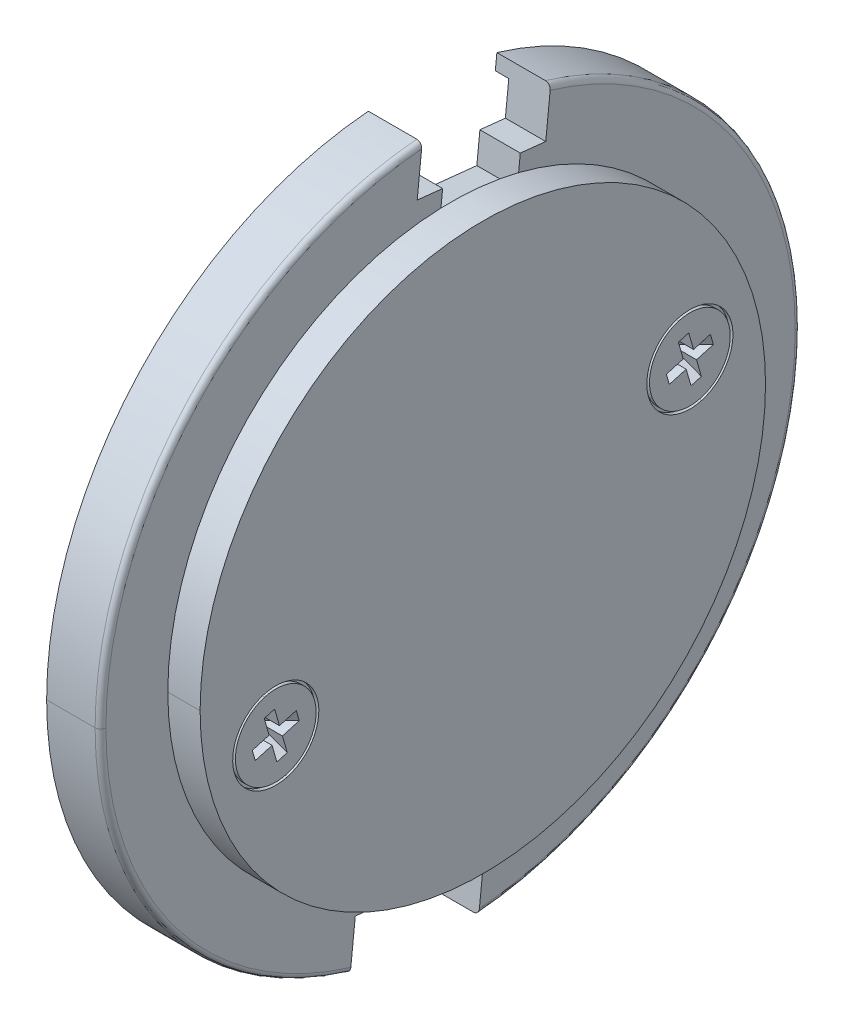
ISO-10303-21;
HEADER;
FILE_DESCRIPTION(('STEP AP214'),'2;1');
FILE_NAME('part.step','',(''),(''),'','','');
FILE_SCHEMA(('AUTOMOTIVE_DESIGN { 1 0 10303 214 1 1 1 1 }'));
ENDSEC;
DATA;
#1=APPLICATION_CONTEXT('core data for automotive mechanical design processes');
#2=APPLICATION_PROTOCOL_DEFINITION('international standard','automotive_design',2000,#1);
#3=PRODUCT_CONTEXT('',#1,'mechanical');
#4=PRODUCT('Part','Part','',(#3));
#5=PRODUCT_RELATED_PRODUCT_CATEGORY('part','',(#4));
#6=PRODUCT_DEFINITION_FORMATION('','',#4);
#7=PRODUCT_DEFINITION_CONTEXT('part definition',#1,'design');
#8=PRODUCT_DEFINITION('design','',#6,#7);
#9=PRODUCT_DEFINITION_SHAPE('','',#8);
#10=(LENGTH_UNIT() NAMED_UNIT(*) SI_UNIT(.MILLI.,.METRE.));
#11=(NAMED_UNIT(*) PLANE_ANGLE_UNIT() SI_UNIT($,.RADIAN.));
#12=(NAMED_UNIT(*) SI_UNIT($,.STERADIAN.) SOLID_ANGLE_UNIT());
#13=UNCERTAINTY_MEASURE_WITH_UNIT(LENGTH_MEASURE(1.E-05),#10,'distance_accuracy_value','');
#14=(GEOMETRIC_REPRESENTATION_CONTEXT(3) GLOBAL_UNCERTAINTY_ASSIGNED_CONTEXT((#13)) GLOBAL_UNIT_ASSIGNED_CONTEXT((#10,
#11,#12)) REPRESENTATION_CONTEXT('',''));
#15=CARTESIAN_POINT('',(0.,0.,0.));
#16=DIRECTION('',(0.,0.,1.));
#17=DIRECTION('',(1.,0.,0.));
#18=AXIS2_PLACEMENT_3D('',#15,#16,#17);
#19=CARTESIAN_POINT('',(73.25,0.,0.));
#20=DIRECTION('',(1.,0.,0.));
#21=DIRECTION('',(0.,0.,-1.));
#22=AXIS2_PLACEMENT_3D('',#19,#20,#21);
#23=CYLINDRICAL_SURFACE('',#22,12.45);
#24=DIRECTION('',(1.,0.,0.));
#25=VECTOR('',#24,1.);
#26=CARTESIAN_POINT('',(73.25,0.,12.45));
#27=LINE('',#26,#25);
#28=CARTESIAN_POINT('',(73.,0.,12.45));
#29=VERTEX_POINT('',#28);
#30=CARTESIAN_POINT('',(73.5,0.,12.45));
#31=VERTEX_POINT('',#30);
#32=EDGE_CURVE('E42',#29,#31,#27,.T.);
#33=ORIENTED_EDGE('',*,*,#32,.F.);
#34=CARTESIAN_POINT('',(73.,0.,0.));
#35=DIRECTION('',(1.,0.,0.));
#36=DIRECTION('',(0.,0.,-1.));
#37=AXIS2_PLACEMENT_3D('',#34,#35,#36);
#38=CIRCLE('',#37,12.45);
#39=CARTESIAN_POINT('',(73.,12.40042989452,1.10988216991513));
#40=VERTEX_POINT('',#39);
#41=EDGE_CURVE('E788',#40,#29,#38,.T.);
#42=ORIENTED_EDGE('',*,*,#41,.F.);
#43=DIRECTION('',(1.,0.,0.));
#44=VECTOR('',#43,1.);
#45=CARTESIAN_POINT('',(73.25,12.40042989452,1.10988216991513));
#46=LINE('',#45,#44);
#47=CARTESIAN_POINT('',(73.5,12.40042989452,1.10988216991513));
#48=VERTEX_POINT('',#47);
#49=EDGE_CURVE('E11',#40,#48,#46,.T.);
#50=ORIENTED_EDGE('',*,*,#49,.T.);
#51=CARTESIAN_POINT('',(73.5,0.,0.));
#52=DIRECTION('',(1.,0.,0.));
#53=DIRECTION('',(0.,0.,-1.));
#54=AXIS2_PLACEMENT_3D('',#51,#52,#53);
#55=CIRCLE('',#54,12.45);
#56=EDGE_CURVE('E28',#48,#31,#55,.T.);
#57=ORIENTED_EDGE('',*,*,#56,.T.);
#58=EDGE_LOOP('',(#33,#42,#50,#57));
#59=FACE_BOUND('',#58,.T.);
#60=ADVANCED_FACE('F17',(#59),#23,.F.);
#61=CARTESIAN_POINT('',(75.6,0.,0.));
#62=DIRECTION('',(1.,0.,0.));
#63=DIRECTION('',(0.,0.,-1.));
#64=AXIS2_PLACEMENT_3D('',#61,#62,#63);
#65=CYLINDRICAL_SURFACE('',#64,10.5);
#66=DIRECTION('',(1.,0.,0.));
#67=VECTOR('',#66,1.);
#68=CARTESIAN_POINT('',(75.6,0.,-10.5));
#69=LINE('',#68,#67);
#70=CARTESIAN_POINT('',(75.000000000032,0.,-10.5));
#71=VERTEX_POINT('',#70);
#72=CARTESIAN_POINT('',(76.2,0.,-10.5));
#73=VERTEX_POINT('',#72);
#74=EDGE_CURVE('E724',#71,#73,#69,.T.);
#75=ORIENTED_EDGE('',*,*,#74,.F.);
#76=CARTESIAN_POINT('',(74.99999999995,0.,0.));
#77=DIRECTION('',(-1.,0.,-7.81250064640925E-12));
#78=DIRECTION('',(7.81250064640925E-12,0.,-1.));
#79=AXIS2_PLACEMENT_3D('',#76,#77,#78);
#80=CIRCLE('',#79,10.5);
#81=CARTESIAN_POINT('',(74.9999999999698,10.190863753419,-2.52908994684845));
#82=VERTEX_POINT('',#81);
#83=EDGE_CURVE('E888',#82,#71,#80,.T.);
#84=ORIENTED_EDGE('',*,*,#83,.F.);
#85=CARTESIAN_POINT('',(74.99999999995,0.,0.));
#86=DIRECTION('',(-1.,0.,-7.81250064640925E-12));
#87=DIRECTION('',(7.81250064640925E-12,0.,-1.));
#88=AXIS2_PLACEMENT_3D('',#85,#86,#87);
#89=CIRCLE('',#88,10.5);
#90=CARTESIAN_POINT('',(74.9999999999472,10.4939962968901,0.355023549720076));
#91=VERTEX_POINT('',#90);
#92=EDGE_CURVE('E779',#91,#82,#89,.T.);
#93=ORIENTED_EDGE('',*,*,#92,.F.);
#94=CARTESIAN_POINT('',(74.99999999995,0.,0.));
#95=DIRECTION('',(-1.,0.,-7.81250064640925E-12));
#96=DIRECTION('',(7.81250064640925E-12,0.,-1.));
#97=AXIS2_PLACEMENT_3D('',#94,#95,#96);
#98=CIRCLE('',#97,10.5);
#99=CARTESIAN_POINT('',(74.999999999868,0.,10.5));
#100=VERTEX_POINT('',#99);
#101=EDGE_CURVE('E917',#100,#91,#98,.T.);
#102=ORIENTED_EDGE('',*,*,#101,.F.);
#103=DIRECTION('',(-1.,0.,0.));
#104=VECTOR('',#103,1.);
#105=CARTESIAN_POINT('',(75.6,0.,10.5));
#106=LINE('',#105,#104);
#107=CARTESIAN_POINT('',(76.2,0.,10.5));
#108=VERTEX_POINT('',#107);
#109=EDGE_CURVE('E699',#108,#100,#106,.T.);
#110=ORIENTED_EDGE('',*,*,#109,.F.);
#111=CARTESIAN_POINT('',(76.2,0.,0.));
#112=DIRECTION('',(1.,0.,0.));
#113=DIRECTION('',(0.,0.,-1.));
#114=AXIS2_PLACEMENT_3D('',#111,#112,#113);
#115=CIRCLE('',#114,10.5);
#116=EDGE_CURVE('E606',#73,#108,#115,.T.);
#117=ORIENTED_EDGE('',*,*,#116,.F.);
#118=EDGE_LOOP('',(#75,#84,#93,#102,#110,#117));
#119=FACE_BOUND('',#118,.T.);
#120=ADVANCED_FACE('F1169',(#119),#65,.T.);
#121=CARTESIAN_POINT('',(76.125,-2.2050988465,7.6900935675));
#122=DIRECTION('',(1.,0.,0.));
#123=DIRECTION('',(0.,-0.961261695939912,-0.275637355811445));
#124=AXIS2_PLACEMENT_3D('',#121,#122,#123);
#125=CYLINDRICAL_SURFACE('',#124,1.6);
#126=DIRECTION('',(-1.,0.,0.));
#127=VECTOR('',#126,1.);
#128=CARTESIAN_POINT('',(76.125,-3.74311756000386,7.24907379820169));
#129=LINE('',#128,#127);
#130=CARTESIAN_POINT('',(76.2,-3.74311756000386,7.24907379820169));
#131=VERTEX_POINT('',#130);
#132=CARTESIAN_POINT('',(76.05,-3.74311756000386,7.24907379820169));
#133=VERTEX_POINT('',#132);
#134=EDGE_CURVE('E934',#131,#133,#129,.T.);
#135=ORIENTED_EDGE('',*,*,#134,.F.);
#136=CARTESIAN_POINT('',(76.2,-2.2050988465,7.6900935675));
#137=DIRECTION('',(-1.,0.,0.));
#138=DIRECTION('',(0.,-0.961261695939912,-0.275637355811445));
#139=AXIS2_PLACEMENT_3D('',#136,#137,#138);
#140=CIRCLE('',#139,1.6);
#141=CARTESIAN_POINT('',(76.2,-0.667080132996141,8.13111333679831));
#142=VERTEX_POINT('',#141);
#143=EDGE_CURVE('E1394',#142,#131,#140,.T.);
#144=ORIENTED_EDGE('',*,*,#143,.F.);
#145=DIRECTION('',(1.,0.,0.));
#146=VECTOR('',#145,1.);
#147=CARTESIAN_POINT('',(76.125,-0.667080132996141,8.13111333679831));
#148=LINE('',#147,#146);
#149=CARTESIAN_POINT('',(76.05,-0.667080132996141,8.13111333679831));
#150=VERTEX_POINT('',#149);
#151=EDGE_CURVE('E924',#150,#142,#148,.T.);
#152=ORIENTED_EDGE('',*,*,#151,.F.);
#153=CARTESIAN_POINT('',(76.05,-2.2050988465,7.6900935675));
#154=DIRECTION('',(1.,0.,0.));
#155=DIRECTION('',(0.,-0.961261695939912,-0.275637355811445));
#156=AXIS2_PLACEMENT_3D('',#153,#154,#155);
#157=CIRCLE('',#156,1.6);
#158=EDGE_CURVE('E669',#133,#150,#157,.T.);
#159=ORIENTED_EDGE('',*,*,#158,.F.);
#160=EDGE_LOOP('',(#135,#144,#152,#159));
#161=FACE_BOUND('',#160,.T.);
#162=ADVANCED_FACE('F1172',(#161),#125,.F.);
#163=CARTESIAN_POINT('',(76.125,2.2050988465,-7.6900935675));
#164=DIRECTION('',(1.,0.,0.));
#165=DIRECTION('',(0.,0.961261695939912,0.275637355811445));
#166=AXIS2_PLACEMENT_3D('',#163,#164,#165);
#167=CYLINDRICAL_SURFACE('',#166,1.6);
#168=DIRECTION('',(-1.,0.,0.));
#169=VECTOR('',#168,1.);
#170=CARTESIAN_POINT('',(76.125,3.74311756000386,-7.24907379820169));
#171=LINE('',#170,#169);
#172=CARTESIAN_POINT('',(76.2,3.74311756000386,-7.24907379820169));
#173=VERTEX_POINT('',#172);
#174=CARTESIAN_POINT('',(76.05,3.74311756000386,-7.24907379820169));
#175=VERTEX_POINT('',#174);
#176=EDGE_CURVE('E352',#173,#175,#171,.T.);
#177=ORIENTED_EDGE('',*,*,#176,.F.);
#178=CARTESIAN_POINT('',(76.2,2.2050988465,-7.6900935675));
#179=DIRECTION('',(-1.,0.,0.));
#180=DIRECTION('',(0.,0.961261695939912,0.275637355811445));
#181=AXIS2_PLACEMENT_3D('',#178,#179,#180);
#182=CIRCLE('',#181,1.6);
#183=CARTESIAN_POINT('',(76.2,0.667080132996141,-8.13111333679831));
#184=VERTEX_POINT('',#183);
#185=EDGE_CURVE('E602',#184,#173,#182,.T.);
#186=ORIENTED_EDGE('',*,*,#185,.F.);
#187=DIRECTION('',(1.,0.,0.));
#188=VECTOR('',#187,1.);
#189=CARTESIAN_POINT('',(76.125,0.667080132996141,-8.13111333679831));
#190=LINE('',#189,#188);
#191=CARTESIAN_POINT('',(76.05,0.667080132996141,-8.13111333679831));
#192=VERTEX_POINT('',#191);
#193=EDGE_CURVE('E340',#192,#184,#190,.T.);
#194=ORIENTED_EDGE('',*,*,#193,.F.);
#195=CARTESIAN_POINT('',(76.05,2.2050988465,-7.6900935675));
#196=DIRECTION('',(1.,0.,0.));
#197=DIRECTION('',(0.,0.961261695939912,0.275637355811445));
#198=AXIS2_PLACEMENT_3D('',#195,#196,#197);
#199=CIRCLE('',#198,1.6);
#200=EDGE_CURVE('E611',#175,#192,#199,.T.);
#201=ORIENTED_EDGE('',*,*,#200,.F.);
#202=EDGE_LOOP('',(#177,#186,#194,#201));
#203=FACE_BOUND('',#202,.T.);
#204=ADVANCED_FACE('F2313',(#203),#167,.F.);
#205=CARTESIAN_POINT('',(76.125,-2.2050988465,7.6900935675));
#206=DIRECTION('',(1.,0.,0.));
#207=DIRECTION('',(0.,-0.961261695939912,-0.275637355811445));
#208=AXIS2_PLACEMENT_3D('',#205,#206,#207);
#209=CYLINDRICAL_SURFACE('',#208,1.5);
#210=DIRECTION('',(1.,0.,0.));
#211=VECTOR('',#210,1.);
#212=CARTESIAN_POINT('',(76.125,-3.64699139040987,7.27663753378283));
#213=LINE('',#212,#211);
#214=CARTESIAN_POINT('',(76.05,-3.64699139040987,7.27663753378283));
#215=VERTEX_POINT('',#214);
#216=CARTESIAN_POINT('',(76.2,-3.64699139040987,7.27663753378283));
#217=VERTEX_POINT('',#216);
#218=EDGE_CURVE('E662',#215,#217,#213,.T.);
#219=ORIENTED_EDGE('',*,*,#218,.F.);
#220=CARTESIAN_POINT('',(76.05,-2.2050988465,7.6900935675));
#221=DIRECTION('',(-1.,0.,0.));
#222=DIRECTION('',(0.,-0.961261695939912,-0.275637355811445));
#223=AXIS2_PLACEMENT_3D('',#220,#221,#222);
#224=CIRCLE('',#223,1.5);
#225=CARTESIAN_POINT('',(76.05,-0.763206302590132,8.10354960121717));
#226=VERTEX_POINT('',#225);
#227=EDGE_CURVE('E759',#226,#215,#224,.T.);
#228=ORIENTED_EDGE('',*,*,#227,.F.);
#229=DIRECTION('',(-1.,0.,0.));
#230=VECTOR('',#229,1.);
#231=CARTESIAN_POINT('',(76.125,-0.763206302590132,8.10354960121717));
#232=LINE('',#231,#230);
#233=CARTESIAN_POINT('',(76.2,-0.763206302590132,8.10354960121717));
#234=VERTEX_POINT('',#233);
#235=EDGE_CURVE('E665',#234,#226,#232,.T.);
#236=ORIENTED_EDGE('',*,*,#235,.F.);
#237=CARTESIAN_POINT('',(76.2,-2.2050988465,7.6900935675));
#238=DIRECTION('',(1.,0.,0.));
#239=DIRECTION('',(0.,-0.961261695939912,-0.275637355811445));
#240=AXIS2_PLACEMENT_3D('',#237,#238,#239);
#241=CIRCLE('',#240,1.5);
#242=EDGE_CURVE('E843',#217,#234,#241,.T.);
#243=ORIENTED_EDGE('',*,*,#242,.F.);
#244=EDGE_LOOP('',(#219,#228,#236,#243));
#245=FACE_BOUND('',#244,.T.);
#246=ADVANCED_FACE('F2310',(#245),#209,.T.);
#247=CARTESIAN_POINT('',(76.125,2.2050988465,-7.6900935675));
#248=DIRECTION('',(1.,0.,0.));
#249=DIRECTION('',(0.,0.961261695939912,0.275637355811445));
#250=AXIS2_PLACEMENT_3D('',#247,#248,#249);
#251=CYLINDRICAL_SURFACE('',#250,1.5);
#252=DIRECTION('',(1.,0.,0.));
#253=VECTOR('',#252,1.);
#254=CARTESIAN_POINT('',(76.125,3.64699139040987,-7.27663753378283));
#255=LINE('',#254,#253);
#256=CARTESIAN_POINT('',(76.05,3.64699139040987,-7.27663753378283));
#257=VERTEX_POINT('',#256);
#258=CARTESIAN_POINT('',(76.2,3.64699139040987,-7.27663753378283));
#259=VERTEX_POINT('',#258);
#260=EDGE_CURVE('E743',#257,#259,#255,.T.);
#261=ORIENTED_EDGE('',*,*,#260,.F.);
#262=CARTESIAN_POINT('',(76.05,2.2050988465,-7.6900935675));
#263=DIRECTION('',(-1.,0.,0.));
#264=DIRECTION('',(0.,0.961261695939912,0.275637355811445));
#265=AXIS2_PLACEMENT_3D('',#262,#263,#264);
#266=CIRCLE('',#265,1.5);
#267=CARTESIAN_POINT('',(76.05,0.763206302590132,-8.10354960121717));
#268=VERTEX_POINT('',#267);
#269=EDGE_CURVE('E782',#268,#257,#266,.T.);
#270=ORIENTED_EDGE('',*,*,#269,.F.);
#271=DIRECTION('',(-1.,0.,0.));
#272=VECTOR('',#271,1.);
#273=CARTESIAN_POINT('',(76.125,0.763206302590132,-8.10354960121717));
#274=LINE('',#273,#272);
#275=CARTESIAN_POINT('',(76.2,0.763206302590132,-8.10354960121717));
#276=VERTEX_POINT('',#275);
#277=EDGE_CURVE('E739',#276,#268,#274,.T.);
#278=ORIENTED_EDGE('',*,*,#277,.F.);
#279=CARTESIAN_POINT('',(76.2,2.2050988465,-7.6900935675));
#280=DIRECTION('',(1.,0.,0.));
#281=DIRECTION('',(0.,0.961261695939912,0.275637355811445));
#282=AXIS2_PLACEMENT_3D('',#279,#280,#281);
#283=CIRCLE('',#282,1.5);
#284=EDGE_CURVE('E1533',#259,#276,#283,.T.);
#285=ORIENTED_EDGE('',*,*,#284,.F.);
#286=EDGE_LOOP('',(#261,#270,#278,#285));
#287=FACE_BOUND('',#286,.T.);
#288=ADVANCED_FACE('F19',(#287),#251,.T.);
#289=CARTESIAN_POINT('',(73.25,0.,0.));
#290=DIRECTION('',(1.,0.,0.));
#291=DIRECTION('',(0.,0.,-1.));
#292=AXIS2_PLACEMENT_3D('',#289,#290,#291);
#293=CYLINDRICAL_SURFACE('',#292,12.45);
#294=DIRECTION('',(-1.,0.,0.));
#295=VECTOR('',#294,1.);
#296=CARTESIAN_POINT('',(73.25,0.,-12.45));
#297=LINE('',#296,#295);
#298=CARTESIAN_POINT('',(73.5,0.,-12.45));
#299=VERTEX_POINT('',#298);
#300=CARTESIAN_POINT('',(73.,0.,-12.45));
#301=VERTEX_POINT('',#300);
#302=EDGE_CURVE('E632',#299,#301,#297,.T.);
#303=ORIENTED_EDGE('',*,*,#302,.F.);
#304=CARTESIAN_POINT('',(73.5,0.,0.));
#305=DIRECTION('',(1.,0.,0.));
#306=DIRECTION('',(0.,0.,-1.));
#307=AXIS2_PLACEMENT_3D('',#304,#305,#306);
#308=CIRCLE('',#307,12.45);
#309=CARTESIAN_POINT('',(73.5,11.8986932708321,-3.66382292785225));
#310=VERTEX_POINT('',#309);
#311=EDGE_CURVE('E660',#299,#310,#308,.T.);
#312=ORIENTED_EDGE('',*,*,#311,.T.);
#313=DIRECTION('',(-1.,0.,0.));
#314=VECTOR('',#313,1.);
#315=CARTESIAN_POINT('',(73.25,11.8986932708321,-3.66382292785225));
#316=LINE('',#315,#314);
#317=CARTESIAN_POINT('',(73.,11.8986932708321,-3.66382292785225));
#318=VERTEX_POINT('',#317);
#319=EDGE_CURVE('E656',#310,#318,#316,.T.);
#320=ORIENTED_EDGE('',*,*,#319,.T.);
#321=CARTESIAN_POINT('',(73.,0.,0.));
#322=DIRECTION('',(1.,0.,0.));
#323=DIRECTION('',(0.,0.,-1.));
#324=AXIS2_PLACEMENT_3D('',#321,#322,#323);
#325=CIRCLE('',#324,12.45);
#326=EDGE_CURVE('E989',#301,#318,#325,.T.);
#327=ORIENTED_EDGE('',*,*,#326,.F.);
#328=EDGE_LOOP('',(#303,#312,#320,#327));
#329=FACE_BOUND('',#328,.T.);
#330=ADVANCED_FACE('F1021',(#329),#293,.F.);
#331=CARTESIAN_POINT('',(73.9,0.,0.));
#332=DIRECTION('',(1.,0.,0.));
#333=DIRECTION('',(0.,0.,1.));
#334=AXIS2_PLACEMENT_3D('',#331,#332,#333);
#335=CYLINDRICAL_SURFACE('',#334,13.);
#336=DIRECTION('',(1.,0.,0.));
#337=VECTOR('',#336,1.);
#338=CARTESIAN_POINT('',(73.9,0.,13.));
#339=LINE('',#338,#337);
#340=CARTESIAN_POINT('',(73.,0.,13.));
#341=VERTEX_POINT('',#340);
#342=CARTESIAN_POINT('',(74.8,0.,13.));
#343=VERTEX_POINT('',#342);
#344=EDGE_CURVE('E834',#341,#343,#339,.T.);
#345=ORIENTED_EDGE('',*,*,#344,.F.);
#346=CARTESIAN_POINT('',(73.,0.,0.));
#347=DIRECTION('',(1.,0.,0.));
#348=DIRECTION('',(0.,0.,1.));
#349=AXIS2_PLACEMENT_3D('',#346,#347,#348);
#350=CIRCLE('',#349,13.);
#351=CARTESIAN_POINT('',(73.,-12.4556814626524,3.72236474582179));
#352=VERTEX_POINT('',#351);
#353=EDGE_CURVE('E661',#341,#352,#350,.T.);
#354=ORIENTED_EDGE('',*,*,#353,.T.);
#355=DIRECTION('',(1.,0.,0.));
#356=VECTOR('',#355,1.);
#357=CARTESIAN_POINT('',(73.9,-12.4556814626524,3.72236474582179));
#358=LINE('',#357,#356);
#359=CARTESIAN_POINT('',(74.8,-12.4556814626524,3.72236474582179));
#360=VERTEX_POINT('',#359);
#361=EDGE_CURVE('E1457',#352,#360,#358,.T.);
#362=ORIENTED_EDGE('',*,*,#361,.T.);
#363=CARTESIAN_POINT('',(74.8,0.,0.));
#364=DIRECTION('',(1.,0.,0.));
#365=DIRECTION('',(0.,0.,1.));
#366=AXIS2_PLACEMENT_3D('',#363,#364,#365);
#367=CIRCLE('',#366,13.);
#368=EDGE_CURVE('E1138',#343,#360,#367,.T.);
#369=ORIENTED_EDGE('',*,*,#368,.F.);
#370=EDGE_LOOP('',(#345,#354,#362,#369));
#371=FACE_BOUND('',#370,.T.);
#372=ADVANCED_FACE('F1018',(#371),#335,.T.);
#373=CARTESIAN_POINT('',(74.7999999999,0.,0.));
#374=DIRECTION('',(1.,0.,0.));
#375=DIRECTION('',(0.,0.,-1.));
#376=AXIS2_PLACEMENT_3D('',#373,#374,#375);
#377=TOROIDAL_SURFACE('',#376,12.7999999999,0.2);
#378=CARTESIAN_POINT('',(74.7999999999,0.,12.7999999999));
#379=DIRECTION('',(0.,-1.,0.));
#380=DIRECTION('',(0.,0.,1.));
#381=AXIS2_PLACEMENT_3D('',#378,#379,#380);
#382=CIRCLE('',#381,0.2);
#383=CARTESIAN_POINT('',(74.9999999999,0.,12.7999999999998));
#384=VERTEX_POINT('',#383);
#385=EDGE_CURVE('E918',#384,#343,#382,.T.);
#386=ORIENTED_EDGE('',*,*,#385,.F.);
#387=CARTESIAN_POINT('',(74.9999999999,0.,0.));
#388=DIRECTION('',(1.,0.,0.));
#389=DIRECTION('',(0.,0.,1.));
#390=AXIS2_PLACEMENT_3D('',#387,#388,#389);
#391=CIRCLE('',#390,12.7999999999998);
#392=CARTESIAN_POINT('',(74.9999999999,12.7549790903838,1.07261754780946));
#393=VERTEX_POINT('',#392);
#394=EDGE_CURVE('E1994',#393,#384,#391,.T.);
#395=ORIENTED_EDGE('',*,*,#394,.F.);
#396=CARTESIAN_POINT('',(74.9999999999,12.7549790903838,1.07261754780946));
#397=CARTESIAN_POINT('',(75.000000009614,12.757083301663,1.07239638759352));
#398=CARTESIAN_POINT('',(74.9999676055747,12.7591875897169,1.07217605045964));
#399=CARTESIAN_POINT('',(74.9998389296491,12.7633645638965,1.07174005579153));
#400=CARTESIAN_POINT('',(74.9997435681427,12.7654372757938,1.0715243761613));
#401=CARTESIAN_POINT('',(74.9994917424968,12.769549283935,1.07109756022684));
#402=CARTESIAN_POINT('',(74.9993361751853,12.7715886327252,1.07088640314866));
#403=CARTESIAN_POINT('',(74.998966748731,12.775632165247,1.07046852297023));
#404=CARTESIAN_POINT('',(74.9987537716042,12.7776364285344,1.07026178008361));
#405=CARTESIAN_POINT('',(74.9980369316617,12.7835499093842,1.06965260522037));
#406=CARTESIAN_POINT('',(74.9974495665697,12.7874495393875,1.06925193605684));
#407=CARTESIAN_POINT('',(74.9960716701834,12.7950912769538,1.06846728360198));
#408=CARTESIAN_POINT('',(74.9952878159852,12.7988345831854,1.06808316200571));
#409=CARTESIAN_POINT('',(74.9935390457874,12.8061559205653,1.06733107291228));
#410=CARTESIAN_POINT('',(74.9925805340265,12.8097354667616,1.06696297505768));
#411=CARTESIAN_POINT('',(74.9905041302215,12.8167232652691,1.06624262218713));
#412=CARTESIAN_POINT('',(74.9893923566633,12.8201333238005,1.0658902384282));
#413=CARTESIAN_POINT('',(74.9870304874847,12.8267782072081,1.06520115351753));
#414=CARTESIAN_POINT('',(74.9857862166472,12.8300150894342,1.06486432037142));
#415=CARTESIAN_POINT('',(74.9831796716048,12.8363114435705,1.06420632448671));
#416=CARTESIAN_POINT('',(74.981822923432,12.839373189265,1.06388502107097));
#417=CARTESIAN_POINT('',(74.979010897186,12.8453187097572,1.06325820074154));
#418=CARTESIAN_POINT('',(74.9775608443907,12.8482049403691,1.06295252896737));
#419=CARTESIAN_POINT('',(74.9745807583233,12.8538002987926,1.06235720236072));
#420=CARTESIAN_POINT('',(74.9730556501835,12.8565120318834,1.06206737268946));
#421=CARTESIAN_POINT('',(74.9699430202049,12.8617605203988,1.06150405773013));
#422=CARTESIAN_POINT('',(74.9683601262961,12.8642999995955,1.06123037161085));
#423=CARTESIAN_POINT('',(74.9651484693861,12.8692071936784,1.06069976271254));
#424=CARTESIAN_POINT('',(74.9635240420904,12.8715777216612,1.0604426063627));
#425=CARTESIAN_POINT('',(74.9602448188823,12.8761511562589,1.05994552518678));
#426=CARTESIAN_POINT('',(74.9585940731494,12.8783569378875,1.0597053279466));
#427=CARTESIAN_POINT('',(74.955276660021,12.8826057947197,1.05924277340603));
#428=CARTESIAN_POINT('',(74.9536137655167,12.8846517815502,1.05902009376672));
#429=CARTESIAN_POINT('',(74.9502854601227,12.888586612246,1.05859295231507));
#430=CARTESIAN_POINT('',(74.948623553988,12.8904783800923,1.0583881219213));
#431=CARTESIAN_POINT('',(74.9453095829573,12.8941107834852,1.05799807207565));
#432=CARTESIAN_POINT('',(74.9436607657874,12.8958543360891,1.0578123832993));
#433=CARTESIAN_POINT('',(74.9395607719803,12.9000371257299,1.05736973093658));
#434=CARTESIAN_POINT('',(74.9370762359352,12.902444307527,1.05711742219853));
#435=CARTESIAN_POINT('',(74.9320025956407,12.9071119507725,1.05662875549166));
#436=CARTESIAN_POINT('',(74.9294143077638,12.9093732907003,1.05639230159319));
#437=CARTESIAN_POINT('',(74.924141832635,12.9137457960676,1.0559361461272));
#438=CARTESIAN_POINT('',(74.921458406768,12.9158578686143,1.05571634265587));
#439=CARTESIAN_POINT('',(74.9160046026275,12.9199287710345,1.05529305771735));
#440=CARTESIAN_POINT('',(74.9132349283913,12.9218885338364,1.0550894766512));
#441=CARTESIAN_POINT('',(74.9076175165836,12.9256523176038,1.05469858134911));
#442=CARTESIAN_POINT('',(74.904770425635,12.9274572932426,1.05451116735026));
#443=CARTESIAN_POINT('',(74.8990070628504,12.9309095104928,1.05415249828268));
#444=CARTESIAN_POINT('',(74.8960913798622,12.9325577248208,1.0539811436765));
#445=CARTESIAN_POINT('',(74.890199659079,12.9356949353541,1.05365454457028));
#446=CARTESIAN_POINT('',(74.8872241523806,12.9371849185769,1.05349920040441));
#447=CARTESIAN_POINT('',(74.8812215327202,12.9400046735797,1.05320460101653));
#448=CARTESIAN_POINT('',(74.8781948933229,12.941335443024,1.05306524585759));
#449=CARTESIAN_POINT('',(74.872098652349,12.9438362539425,1.05280263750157));
#450=CARTESIAN_POINT('',(74.8690294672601,12.9450073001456,1.05267928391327));
#451=CARTESIAN_POINT('',(74.8628566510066,12.9471886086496,1.05244872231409));
#452=CARTESIAN_POINT('',(74.8597533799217,12.9481998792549,1.05234141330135));
#453=CARTESIAN_POINT('',(74.8535207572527,12.9500620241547,1.05214301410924));
#454=CARTESIAN_POINT('',(74.8503917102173,12.9509139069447,1.05205182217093));
#455=CARTESIAN_POINT('',(74.8441157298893,12.9524580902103,1.05188575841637));
#456=CARTESIAN_POINT('',(74.8409690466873,12.9531513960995,1.05181078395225));
#457=CARTESIAN_POINT('',(74.8346657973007,12.954379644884,1.05167728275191));
#458=CARTESIAN_POINT('',(74.8315094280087,12.9549155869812,1.05161865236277));
#459=CARTESIAN_POINT('',(74.8251946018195,12.9558307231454,1.05151799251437));
#460=CARTESIAN_POINT('',(74.8220362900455,12.9562109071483,1.05147585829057));
#461=CARTESIAN_POINT('',(74.8157251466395,12.9568164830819,1.05140836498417));
#462=CARTESIAN_POINT('',(74.8125724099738,12.9570428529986,1.05138289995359));
#463=CARTESIAN_POINT('',(74.8062797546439,12.9573432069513,1.05134895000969));
#464=CARTESIAN_POINT('',(74.803139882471,12.9574181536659,1.05134035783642));
#465=CARTESIAN_POINT('',(74.8,12.957418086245,1.0513403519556));
#466=B_SPLINE_CURVE_WITH_KNOTS('',3,(#396,#397,#398,#399,#400,#401,#402,#403,#404,#405,#406,
#407,#408,#409,#410,#411,#412,#413,#414,#415,#416,#417,#418,#419,#420,#421,#422,#423,#424,#425,
#426,#427,#428,#429,#430,#431,#432,#433,#434,#435,#436,#437,#438,#439,#440,#441,#442,#443,#444,
#445,#446,#447,#448,#449,#450,#451,#452,#453,#454,#455,#456,#457,#458,#459,#460,#461,#462,#463,
#464,#465),.UNSPECIFIED.,.F.,.F.,(4,2,2,2,2,2,2,2,2,2,2,2,2,2,2,2,2,2,2,2,2,2,2,2,2,2,2,2,2,2,2,
2,2,2,4),(0.,0.00634713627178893,0.0126044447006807,0.0187719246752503,0.0248495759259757,
0.0367341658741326,0.0482595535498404,0.0594257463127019,0.070232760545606,0.0806806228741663,
0.0907693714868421,0.100499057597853,0.109869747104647,0.118881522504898,0.127534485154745,
0.135828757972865,0.143764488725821,0.151341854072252,0.158561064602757,0.168961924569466,
0.179292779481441,0.189554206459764,0.199746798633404,0.209871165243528,0.219927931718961,
0.229917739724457,0.239841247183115,0.249699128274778,0.259492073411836,0.269220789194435,
0.27888599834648,0.288488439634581,0.298028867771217,0.307508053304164,0.316926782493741),.UNSPECIFIED.);
#467=CARTESIAN_POINT('',(74.8,12.9574180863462,1.05134035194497));
#468=VERTEX_POINT('',#467);
#469=EDGE_CURVE('E1001',#393,#468,#466,.T.);
#470=ORIENTED_EDGE('',*,*,#469,.T.);
#471=CARTESIAN_POINT('',(74.8,0.,0.));
#472=DIRECTION('',(1.,0.,0.));
#473=DIRECTION('',(0.,0.,1.));
#474=AXIS2_PLACEMENT_3D('',#471,#472,#473);
#475=CIRCLE('',#474,13.);
#476=EDGE_CURVE('E2039',#468,#343,#475,.T.);
#477=ORIENTED_EDGE('',*,*,#476,.T.);
#478=EDGE_LOOP('',(#386,#395,#470,#477));
#479=FACE_BOUND('',#478,.T.);
#480=ADVANCED_FACE('F1007',(#479),#377,.T.);
#481=CARTESIAN_POINT('',(74.7999999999,0.,0.));
#482=DIRECTION('',(1.,0.,0.));
#483=DIRECTION('',(0.,0.,-1.));
#484=AXIS2_PLACEMENT_3D('',#481,#482,#483);
#485=TOROIDAL_SURFACE('',#484,12.7999999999,0.2);
#486=CARTESIAN_POINT('',(74.7999999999,0.,-12.7999999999));
#487=DIRECTION('',(0.,-1.,0.));
#488=DIRECTION('',(0.,0.,-1.));
#489=AXIS2_PLACEMENT_3D('',#486,#487,#488);
#490=CIRCLE('',#489,0.2);
#491=CARTESIAN_POINT('',(74.8,0.,-13.));
#492=VERTEX_POINT('',#491);
#493=CARTESIAN_POINT('',(74.9999999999,0.,-12.7999999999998));
#494=VERTEX_POINT('',#493);
#495=EDGE_CURVE('E772',#492,#494,#490,.T.);
#496=ORIENTED_EDGE('',*,*,#495,.F.);
#497=CARTESIAN_POINT('',(74.8,0.,0.));
#498=DIRECTION('',(1.,0.,0.));
#499=DIRECTION('',(0.,0.,1.));
#500=AXIS2_PLACEMENT_3D('',#497,#498,#499);
#501=CIRCLE('',#500,13.);
#502=CARTESIAN_POINT('',(74.8,12.4556814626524,-3.72236474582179));
#503=VERTEX_POINT('',#502);
#504=EDGE_CURVE('E1228',#492,#503,#501,.T.);
#505=ORIENTED_EDGE('',*,*,#504,.T.);
#506=CARTESIAN_POINT('',(74.8,12.4556814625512,-3.72236474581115));
#507=CARTESIAN_POINT('',(74.8031383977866,12.4556815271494,-3.72236476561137));
#508=CARTESIAN_POINT('',(74.8062767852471,12.4556064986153,-3.7223576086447));
#509=CARTESIAN_POINT('',(74.8125666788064,12.4553059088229,-3.72232844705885));
#510=CARTESIAN_POINT('',(74.8157181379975,12.455079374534,-3.72230634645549));
#511=CARTESIAN_POINT('',(74.8220269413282,12.4544734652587,-3.72224659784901));
#512=CARTESIAN_POINT('',(74.8251841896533,12.4540931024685,-3.72220884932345));
#513=CARTESIAN_POINT('',(74.831497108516,12.4531776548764,-3.72211722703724));
#514=CARTESIAN_POINT('',(74.834652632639,12.4526415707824,-3.72206324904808));
#515=CARTESIAN_POINT('',(74.8409544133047,12.4514131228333,-3.72193868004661));
#516=CARTESIAN_POINT('',(74.8441004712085,12.4507197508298,-3.72186798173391));
#517=CARTESIAN_POINT('',(74.8503754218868,12.4491755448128,-3.72170959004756));
#518=CARTESIAN_POINT('',(74.8535040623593,12.448323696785,-3.72162178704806));
#519=CARTESIAN_POINT('',(74.8597360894,12.4464617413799,-3.72142891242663));
#520=CARTESIAN_POINT('',(74.8628391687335,12.4454506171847,-3.72132372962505));
#521=CARTESIAN_POINT('',(74.8690118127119,12.4432697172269,-3.7210959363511));
#522=CARTESIAN_POINT('',(74.8720810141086,12.4420989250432,-3.7209732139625));
#523=CARTESIAN_POINT('',(74.8781774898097,12.4395987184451,-3.72071030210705));
#524=CARTESIAN_POINT('',(74.8812043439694,12.4382682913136,-3.72057000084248));
#525=CARTESIAN_POINT('',(74.8872075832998,12.4354492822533,-3.72027201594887));
#526=CARTESIAN_POINT('',(74.8901834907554,12.4339596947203,-3.72011422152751));
#527=CARTESIAN_POINT('',(74.8960761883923,12.4308232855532,-3.71978146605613));
#528=CARTESIAN_POINT('',(74.8989924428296,12.4291754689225,-3.71960639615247));
#529=CARTESIAN_POINT('',(74.9047571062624,12.4257239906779,-3.71923943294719));
#530=CARTESIAN_POINT('',(74.9076049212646,12.42391934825,-3.71904743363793));
#531=CARTESIAN_POINT('',(74.9132239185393,12.4201560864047,-3.71864711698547));
#532=CARTESIAN_POINT('',(74.9159944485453,12.4181965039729,-3.71843869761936));
#533=CARTESIAN_POINT('',(74.9214500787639,12.4141257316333,-3.71800609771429));
#534=CARTESIAN_POINT('',(74.9241344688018,12.4120136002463,-3.71778181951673));
#535=CARTESIAN_POINT('',(74.929408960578,12.4076405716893,-3.71731854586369));
#536=CARTESIAN_POINT('',(74.9319982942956,12.4053787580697,-3.71707946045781));
#537=CARTESIAN_POINT('',(74.9370740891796,12.400709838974,-3.71658647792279));
#538=CARTESIAN_POINT('',(74.9395597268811,12.3983018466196,-3.716332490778));
#539=CARTESIAN_POINT('',(74.9436591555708,12.3941190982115,-3.71589556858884));
#540=CARTESIAN_POINT('',(74.9453064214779,12.3923767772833,-3.71571474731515));
#541=CARTESIAN_POINT('',(74.9486176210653,12.3887460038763,-3.71534119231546));
#542=CARTESIAN_POINT('',(74.9502783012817,12.3868545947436,-3.71514831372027));
#543=CARTESIAN_POINT('',(74.9536044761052,12.382920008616,-3.71474821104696));
#544=CARTESIAN_POINT('',(74.9552664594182,12.3808738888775,-3.71454074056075));
#545=CARTESIAN_POINT('',(74.9585823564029,12.3766244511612,-3.71411001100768));
#546=CARTESIAN_POINT('',(74.9602324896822,12.3744182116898,-3.71388646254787));
#547=CARTESIAN_POINT('',(74.9635107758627,12.3698437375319,-3.71342203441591));
#548=CARTESIAN_POINT('',(74.9651348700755,12.3674726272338,-3.7131808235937));
#549=CARTESIAN_POINT('',(74.9683461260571,12.3625642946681,-3.71267979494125));
#550=CARTESIAN_POINT('',(74.9699289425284,12.3600242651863,-3.71241962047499));
#551=CARTESIAN_POINT('',(74.973041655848,12.3547748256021,-3.71187960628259));
#552=CARTESIAN_POINT('',(74.974566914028,12.3520627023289,-3.71159939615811));
#553=CARTESIAN_POINT('',(74.9775475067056,12.3464667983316,-3.71101854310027));
#554=CARTESIAN_POINT('',(74.9789979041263,12.3435804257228,-3.71071752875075));
#555=CARTESIAN_POINT('',(74.9818107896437,12.3376348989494,-3.71009463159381));
#556=CARTESIAN_POINT('',(74.9831680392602,12.3345733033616,-3.70977238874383));
#557=CARTESIAN_POINT('',(74.9857757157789,12.3282775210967,-3.70910698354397));
#558=CARTESIAN_POINT('',(74.9870206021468,12.3250410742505,-3.70876348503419));
#559=CARTESIAN_POINT('',(74.9893837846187,12.3183972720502,-3.70805595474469));
#560=CARTESIAN_POINT('',(74.9904962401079,12.3149878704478,-3.70769162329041));
#561=CARTESIAN_POINT('',(74.9925740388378,12.3080014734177,-3.70694330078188));
#562=CARTESIAN_POINT('',(74.9935332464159,12.3044226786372,-3.70655905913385));
#563=CARTESIAN_POINT('',(74.9952833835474,12.2971027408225,-3.70577234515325));
#564=CARTESIAN_POINT('',(74.9960678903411,12.2933600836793,-3.705369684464));
#565=CARTESIAN_POINT('',(74.9974470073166,12.2857192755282,-3.70454811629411));
#566=CARTESIAN_POINT('',(74.998034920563,12.2818199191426,-3.70412909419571));
#567=CARTESIAN_POINT('',(74.9987524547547,12.2759064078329,-3.70349521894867));
#568=CARTESIAN_POINT('',(74.9989656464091,12.2739020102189,-3.70328063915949));
#569=CARTESIAN_POINT('',(74.9993354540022,12.2698579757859,-3.70284848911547));
#570=CARTESIAN_POINT('',(74.9994911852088,12.2678182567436,-3.70263092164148));
#571=CARTESIAN_POINT('',(74.9997432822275,12.2637052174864,-3.70219325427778));
#572=CARTESIAN_POINT('',(74.9998387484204,12.2616318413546,-3.7019731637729));
#573=CARTESIAN_POINT('',(74.9999675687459,12.257453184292,-3.7015309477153));
#574=CARTESIAN_POINT('',(75.0000000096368,12.2553478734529,-3.70130883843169));
#575=CARTESIAN_POINT('',(74.9999999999,12.253242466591,-3.70108754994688));
#576=B_SPLINE_CURVE_WITH_KNOTS('',3,(#506,#507,#508,#509,#510,#511,#512,#513,#514,#515,#516,
#517,#518,#519,#520,#521,#522,#523,#524,#525,#526,#527,#528,#529,#530,#531,#532,#533,#534,#535,
#536,#537,#538,#539,#540,#541,#542,#543,#544,#545,#546,#547,#548,#549,#550,#551,#552,#553,#554,
#555,#556,#557,#558,#559,#560,#561,#562,#563,#564,#565,#566,#567,#568,#569,#570,#571,#572,#573,
#574,#575),.UNSPECIFIED.,.F.,.F.,(4,2,2,2,2,2,2,2,2,2,2,2,2,2,2,2,2,2,2,2,2,2,2,2,2,2,2,2,2,2,2,
2,2,2,4),(0.,0.00941427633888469,0.0188896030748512,0.0284267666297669,0.0380265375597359,
0.0476896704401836,0.0574169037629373,0.0672089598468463,0.0770665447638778,0.086990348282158,
0.0969810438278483,0.107039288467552,0.117165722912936,0.12736097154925,0.137625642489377,
0.147960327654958,0.158365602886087,0.16557784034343,0.173149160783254,0.181079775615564,
0.1893698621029,0.198019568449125,0.207029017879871,0.216398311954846,0.226127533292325,
0.236216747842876,0.246666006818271,0.257475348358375,0.268644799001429,0.280174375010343,
0.29206408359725,0.298144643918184,0.3043152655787,0.310575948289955,0.316926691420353),.UNSPECIFIED.);
#577=CARTESIAN_POINT('',(75.,12.253242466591,-3.70108754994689));
#578=VERTEX_POINT('',#577);
#579=EDGE_CURVE('E1222',#503,#578,#576,.T.);
#580=ORIENTED_EDGE('',*,*,#579,.T.);
#581=CARTESIAN_POINT('',(74.9999999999,0.,0.));
#582=DIRECTION('',(1.,0.,0.));
#583=DIRECTION('',(0.,0.,1.));
#584=AXIS2_PLACEMENT_3D('',#581,#582,#583);
#585=CIRCLE('',#584,12.7999999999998);
#586=EDGE_CURVE('E323',#494,#578,#585,.T.);
#587=ORIENTED_EDGE('',*,*,#586,.F.);
#588=EDGE_LOOP('',(#496,#505,#580,#587));
#589=FACE_BOUND('',#588,.T.);
#590=ADVANCED_FACE('F1017',(#589),#485,.T.);
#591=CARTESIAN_POINT('',(73.9,0.,0.));
#592=DIRECTION('',(1.,0.,0.));
#593=DIRECTION('',(0.,0.,1.));
#594=AXIS2_PLACEMENT_3D('',#591,#592,#593);
#595=CYLINDRICAL_SURFACE('',#594,13.);
#596=DIRECTION('',(-1.,0.,0.));
#597=VECTOR('',#596,1.);
#598=CARTESIAN_POINT('',(73.9,0.,-13.));
#599=LINE('',#598,#597);
#600=CARTESIAN_POINT('',(73.,0.,-13.));
#601=VERTEX_POINT('',#600);
#602=EDGE_CURVE('E623',#492,#601,#599,.T.);
#603=ORIENTED_EDGE('',*,*,#602,.F.);
#604=CARTESIAN_POINT('',(74.8,0.,0.));
#605=DIRECTION('',(1.,0.,0.));
#606=DIRECTION('',(0.,0.,1.));
#607=AXIS2_PLACEMENT_3D('',#604,#605,#606);
#608=CIRCLE('',#607,13.);
#609=CARTESIAN_POINT('',(74.8,-12.9574180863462,-1.05134035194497));
#610=VERTEX_POINT('',#609);
#611=EDGE_CURVE('E1593',#610,#492,#608,.T.);
#612=ORIENTED_EDGE('',*,*,#611,.F.);
#613=DIRECTION('',(-1.,0.,0.));
#614=VECTOR('',#613,1.);
#615=CARTESIAN_POINT('',(73.9,-12.9574180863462,-1.05134035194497));
#616=LINE('',#615,#614);
#617=CARTESIAN_POINT('',(73.,-12.9574180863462,-1.05134035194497));
#618=VERTEX_POINT('',#617);
#619=EDGE_CURVE('E971',#610,#618,#616,.T.);
#620=ORIENTED_EDGE('',*,*,#619,.T.);
#621=CARTESIAN_POINT('',(73.,0.,0.));
#622=DIRECTION('',(1.,0.,0.));
#623=DIRECTION('',(0.,0.,1.));
#624=AXIS2_PLACEMENT_3D('',#621,#622,#623);
#625=CIRCLE('',#624,13.);
#626=EDGE_CURVE('E680',#618,#601,#625,.T.);
#627=ORIENTED_EDGE('',*,*,#626,.T.);
#628=EDGE_LOOP('',(#603,#612,#620,#627));
#629=FACE_BOUND('',#628,.T.);
#630=ADVANCED_FACE('F1206',(#629),#595,.T.);
#631=CARTESIAN_POINT('',(65.,0.,0.));
#632=DIRECTION('',(-1.,0.,0.));
#633=DIRECTION('',(0.,0.,-1.));
#634=AXIS2_PLACEMENT_3D('',#631,#632,#633);
#635=CYLINDRICAL_SURFACE('',#634,1.5);
#636=DIRECTION('',(1.,0.,0.));
#637=VECTOR('',#636,1.);
#638=CARTESIAN_POINT('',(74.25,0.,-1.5));
#639=LINE('',#638,#637);
#640=CARTESIAN_POINT('',(73.5,0.,-1.5));
#641=VERTEX_POINT('',#640);
#642=CARTESIAN_POINT('',(75.,0.,-1.5));
#643=VERTEX_POINT('',#642);
#644=EDGE_CURVE('E681',#641,#643,#639,.T.);
#645=ORIENTED_EDGE('',*,*,#644,.F.);
#646=CARTESIAN_POINT('',(73.5,0.,0.));
#647=DIRECTION('',(1.,0.,0.));
#648=DIRECTION('',(0.,0.,-1.));
#649=AXIS2_PLACEMENT_3D('',#646,#647,#648);
#650=CIRCLE('',#649,1.5);
#651=CARTESIAN_POINT('',(73.5,0.,1.5));
#652=VERTEX_POINT('',#651);
#653=EDGE_CURVE('E809',#652,#641,#650,.T.);
#654=ORIENTED_EDGE('',*,*,#653,.F.);
#655=DIRECTION('',(-1.,0.,0.));
#656=VECTOR('',#655,1.);
#657=CARTESIAN_POINT('',(74.25,0.,1.5));
#658=LINE('',#657,#656);
#659=CARTESIAN_POINT('',(75.,0.,1.5));
#660=VERTEX_POINT('',#659);
#661=EDGE_CURVE('E866',#660,#652,#658,.T.);
#662=ORIENTED_EDGE('',*,*,#661,.F.);
#663=CARTESIAN_POINT('',(75.,0.,0.));
#664=DIRECTION('',(1.,0.,0.));
#665=DIRECTION('',(0.,0.,-1.));
#666=AXIS2_PLACEMENT_3D('',#663,#664,#665);
#667=CIRCLE('',#666,1.5);
#668=EDGE_CURVE('E676',#660,#643,#667,.T.);
#669=ORIENTED_EDGE('',*,*,#668,.T.);
#670=EDGE_LOOP('',(#645,#654,#662,#669));
#671=FACE_BOUND('',#670,.T.);
#672=ADVANCED_FACE('F1330',(#671),#635,.F.);
#673=CARTESIAN_POINT('',(65.,0.,0.));
#674=DIRECTION('',(-1.,0.,0.));
#675=DIRECTION('',(0.,0.,-1.));
#676=AXIS2_PLACEMENT_3D('',#673,#674,#675);
#677=CYLINDRICAL_SURFACE('',#676,1.5);
#678=ORIENTED_EDGE('',*,*,#644,.T.);
#679=CARTESIAN_POINT('',(75.,0.,0.));
#680=DIRECTION('',(1.,0.,0.));
#681=DIRECTION('',(0.,0.,-1.));
#682=AXIS2_PLACEMENT_3D('',#679,#680,#681);
#683=CIRCLE('',#682,1.5);
#684=EDGE_CURVE('E862',#643,#660,#683,.T.);
#685=ORIENTED_EDGE('',*,*,#684,.T.);
#686=ORIENTED_EDGE('',*,*,#661,.T.);
#687=CARTESIAN_POINT('',(73.5,0.,0.));
#688=DIRECTION('',(1.,0.,0.));
#689=DIRECTION('',(0.,0.,-1.));
#690=AXIS2_PLACEMENT_3D('',#687,#688,#689);
#691=CIRCLE('',#690,1.5);
#692=EDGE_CURVE('E1375',#641,#652,#691,.T.);
#693=ORIENTED_EDGE('',*,*,#692,.F.);
#694=EDGE_LOOP('',(#678,#685,#686,#693));
#695=FACE_BOUND('',#694,.T.);
#696=ADVANCED_FACE('F1267',(#695),#677,.F.);
#697=CARTESIAN_POINT('',(75.,0.,0.));
#698=DIRECTION('',(1.,0.,0.));
#699=DIRECTION('',(0.,1.,0.));
#700=AXIS2_PLACEMENT_3D('',#697,#698,#699);
#701=PLANE('',#700);
#702=ORIENTED_EDGE('',*,*,#684,.F.);
#703=ORIENTED_EDGE('',*,*,#668,.F.);
#704=EDGE_LOOP('',(#702,#703));
#705=FACE_BOUND('',#704,.T.);
#706=ADVANCED_FACE('F1240',(#705),#701,.F.);
#707=CARTESIAN_POINT('',(74.,11.6833944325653,-3.64119410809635));
#708=DIRECTION('',(0.,0.104528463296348,0.994521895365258));
#709=DIRECTION('',(1.,0.,0.));
#710=AXIS2_PLACEMENT_3D('',#707,#708,#709);
#711=PLANE('',#710);
#712=DIRECTION('',(1.,0.,0.));
#713=VECTOR('',#712,1.);
#714=CARTESIAN_POINT('',(73.9,12.4556814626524,-3.72236474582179));
#715=LINE('',#714,#713);
#716=CARTESIAN_POINT('',(73.,12.4556814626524,-3.72236474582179));
#717=VERTEX_POINT('',#716);
#718=EDGE_CURVE('E775',#717,#503,#715,.T.);
#719=ORIENTED_EDGE('',*,*,#718,.F.);
#720=DIRECTION('',(0.,0.994521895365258,-0.104528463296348));
#721=VECTOR('',#720,1.);
#722=CARTESIAN_POINT('',(73.,5.37840656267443,-2.97851317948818));
#723=LINE('',#722,#721);
#724=EDGE_CURVE('E797',#318,#717,#723,.T.);
#725=ORIENTED_EDGE('',*,*,#724,.F.);
#726=ORIENTED_EDGE('',*,*,#319,.F.);
#727=DIRECTION('',(0.,0.994521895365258,-0.104528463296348));
#728=VECTOR('',#727,1.);
#729=CARTESIAN_POINT('',(73.5,5.71626306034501,-3.01402332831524));
#730=LINE('',#729,#728);
#731=CARTESIAN_POINT('',(73.5,10.6888725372,-3.5366656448));
#732=VERTEX_POINT('',#731);
#733=EDGE_CURVE('E563',#732,#310,#730,.T.);
#734=ORIENTED_EDGE('',*,*,#733,.F.);
#735=DIRECTION('',(-1.,0.,0.));
#736=VECTOR('',#735,1.);
#737=CARTESIAN_POINT('',(74.,10.6888725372,-3.5366656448));
#738=LINE('',#737,#736);
#739=CARTESIAN_POINT('',(75.,10.6888725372,-3.5366656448));
#740=VERTEX_POINT('',#739);
#741=EDGE_CURVE('E619',#740,#732,#738,.T.);
#742=ORIENTED_EDGE('',*,*,#741,.F.);
#743=DIRECTION('',(-8.16628687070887E-13,-0.994521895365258,0.104528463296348));
#744=VECTOR('',#743,1.);
#745=CARTESIAN_POINT('',(75.,5.38360435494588,-2.97905948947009));
#746=LINE('',#745,#744);
#747=EDGE_CURVE('E829',#578,#740,#746,.T.);
#748=ORIENTED_EDGE('',*,*,#747,.F.);
#749=ORIENTED_EDGE('',*,*,#579,.F.);
#750=EDGE_LOOP('',(#719,#725,#726,#734,#742,#748,#749));
#751=FACE_BOUND('',#750,.T.);
#752=ADVANCED_FACE('F1230',(#751),#711,.T.);
#753=CARTESIAN_POINT('',(74.,10.9397408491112,-1.14981309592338));
#754=DIRECTION('',(0.,0.994521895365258,-0.104528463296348));
#755=DIRECTION('',(-1.,0.,0.));
#756=AXIS2_PLACEMENT_3D('',#753,#754,#755);
#757=PLANE('',#756);
#758=DIRECTION('',(1.,0.,0.));
#759=VECTOR('',#758,1.);
#760=CARTESIAN_POINT('',(74.,11.0913071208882,0.292243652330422));
#761=LINE('',#760,#759);
#762=CARTESIAN_POINT('',(73.5,11.0913071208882,0.292243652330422));
#763=VERTEX_POINT('',#762);
#764=CARTESIAN_POINT('',(75.0000000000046,11.0913071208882,0.292243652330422));
#765=VERTEX_POINT('',#764);
#766=EDGE_CURVE('E573',#763,#765,#761,.T.);
#767=ORIENTED_EDGE('',*,*,#766,.F.);
#768=DIRECTION('',(0.,-0.104528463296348,-0.994521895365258));
#769=VECTOR('',#768,1.);
#770=CARTESIAN_POINT('',(73.5,10.9397408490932,-1.14981309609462));
#771=LINE('',#770,#769);
#772=CARTESIAN_POINT('',(73.5,11.1906091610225,1.23703945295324));
#773=VERTEX_POINT('',#772);
#774=EDGE_CURVE('E589',#773,#763,#771,.T.);
#775=ORIENTED_EDGE('',*,*,#774,.F.);
#776=DIRECTION('',(1.,0.,0.));
#777=VECTOR('',#776,1.);
#778=CARTESIAN_POINT('',(74.,11.1906091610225,1.23703945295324));
#779=LINE('',#778,#777);
#780=CARTESIAN_POINT('',(75.,11.1906091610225,1.23703945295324));
#781=VERTEX_POINT('',#780);
#782=EDGE_CURVE('E622',#773,#781,#779,.T.);
#783=ORIENTED_EDGE('',*,*,#782,.T.);
#784=DIRECTION('',(-7.76970295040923E-12,0.104528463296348,0.994521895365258));
#785=VECTOR('',#784,1.);
#786=CARTESIAN_POINT('',(74.9999999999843,11.2723995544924,2.01522306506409));
#787=LINE('',#786,#785);
#788=EDGE_CURVE('E1570',#765,#781,#787,.T.);
#789=ORIENTED_EDGE('',*,*,#788,.F.);
#790=EDGE_LOOP('',(#767,#775,#783,#789));
#791=FACE_BOUND('',#790,.T.);
#792=ADVANCED_FACE('F1239',(#791),#757,.T.);
#793=CARTESIAN_POINT('',(74.,12.1851310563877,1.13251098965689));
#794=DIRECTION('',(0.,0.104528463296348,0.994521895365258));
#795=DIRECTION('',(1.,0.,0.));
#796=AXIS2_PLACEMENT_3D('',#793,#794,#795);
#797=PLANE('',#796);
#798=DIRECTION('',(0.,-0.994521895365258,0.104528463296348));
#799=VECTOR('',#798,1.);
#800=CARTESIAN_POINT('',(73.5,6.21799968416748,1.75968176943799));
#801=LINE('',#800,#799);
#802=EDGE_CURVE('E592',#48,#773,#801,.T.);
#803=ORIENTED_EDGE('',*,*,#802,.F.);
#804=ORIENTED_EDGE('',*,*,#49,.F.);
#805=DIRECTION('',(0.,-0.994521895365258,0.104528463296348));
#806=VECTOR('',#805,1.);
#807=CARTESIAN_POINT('',(73.,5.8801431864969,1.79519191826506));
#808=LINE('',#807,#806);
#809=CARTESIAN_POINT('',(73.,12.9574180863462,1.05134035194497));
#810=VERTEX_POINT('',#809);
#811=EDGE_CURVE('E518',#810,#40,#808,.T.);
#812=ORIENTED_EDGE('',*,*,#811,.F.);
#813=DIRECTION('',(-1.,0.,0.));
#814=VECTOR('',#813,1.);
#815=CARTESIAN_POINT('',(73.9,12.9574180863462,1.05134035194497));
#816=LINE('',#815,#814);
#817=EDGE_CURVE('E770',#468,#810,#816,.T.);
#818=ORIENTED_EDGE('',*,*,#817,.F.);
#819=ORIENTED_EDGE('',*,*,#469,.F.);
#820=DIRECTION('',(8.16628687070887E-13,0.994521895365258,-0.104528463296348));
#821=VECTOR('',#820,1.);
#822=CARTESIAN_POINT('',(75.,5.88534097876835,1.79464560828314));
#823=LINE('',#822,#821);
#824=EDGE_CURVE('E1572',#781,#393,#823,.T.);
#825=ORIENTED_EDGE('',*,*,#824,.F.);
#826=ORIENTED_EDGE('',*,*,#782,.F.);
#827=EDGE_LOOP('',(#803,#804,#812,#818,#819,#825,#826));
#828=FACE_BOUND('',#827,.T.);
#829=ADVANCED_FACE('F1292',(#828),#797,.F.);
#830=CARTESIAN_POINT('',(74.,10.9397408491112,-1.14981309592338));
#831=DIRECTION('',(0.,0.994521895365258,-0.104528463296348));
#832=DIRECTION('',(-1.,0.,0.));
#833=AXIS2_PLACEMENT_3D('',#830,#831,#832);
#834=PLANE('',#833);
#835=DIRECTION('',(0.,-0.104528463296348,-0.994521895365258));
#836=VECTOR('',#835,1.);
#837=CARTESIAN_POINT('',(73.5,10.9397408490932,-1.14981309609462));
#838=LINE('',#837,#836);
#839=CARTESIAN_POINT('',(73.5,10.7881745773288,-2.59186984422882));
#840=VERTEX_POINT('',#839);
#841=EDGE_CURVE('E526',#840,#732,#838,.T.);
#842=ORIENTED_EDGE('',*,*,#841,.F.);
#843=DIRECTION('',(-1.,0.,0.));
#844=VECTOR('',#843,1.);
#845=CARTESIAN_POINT('',(74.,10.7881745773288,-2.59186984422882));
#846=LINE('',#845,#844);
#847=CARTESIAN_POINT('',(75.,10.7881745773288,-2.59186984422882));
#848=VERTEX_POINT('',#847);
#849=EDGE_CURVE('E534',#848,#840,#846,.T.);
#850=ORIENTED_EDGE('',*,*,#849,.F.);
#851=DIRECTION('',(-7.76970295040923E-12,0.104528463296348,0.994521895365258));
#852=VECTOR('',#851,1.);
#853=CARTESIAN_POINT('',(74.9999999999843,11.2723995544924,2.01522306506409));
#854=LINE('',#853,#852);
#855=EDGE_CURVE('E826',#740,#848,#854,.T.);
#856=ORIENTED_EDGE('',*,*,#855,.F.);
#857=ORIENTED_EDGE('',*,*,#741,.T.);
#858=EDGE_LOOP('',(#842,#850,#856,#857));
#859=FACE_BOUND('',#858,.T.);
#860=ADVANCED_FACE('F1294',(#859),#834,.T.);
#861=CARTESIAN_POINT('',(73.9,0.,0.));
#862=DIRECTION('',(1.,0.,0.));
#863=DIRECTION('',(0.,0.,1.));
#864=AXIS2_PLACEMENT_3D('',#861,#862,#863);
#865=CYLINDRICAL_SURFACE('',#864,13.);
#866=ORIENTED_EDGE('',*,*,#602,.T.);
#867=CARTESIAN_POINT('',(73.,0.,0.));
#868=DIRECTION('',(1.,0.,0.));
#869=DIRECTION('',(0.,0.,1.));
#870=AXIS2_PLACEMENT_3D('',#867,#868,#869);
#871=CIRCLE('',#870,13.);
#872=EDGE_CURVE('E858',#601,#717,#871,.T.);
#873=ORIENTED_EDGE('',*,*,#872,.T.);
#874=ORIENTED_EDGE('',*,*,#718,.T.);
#875=ORIENTED_EDGE('',*,*,#504,.F.);
#876=EDGE_LOOP('',(#866,#873,#874,#875));
#877=FACE_BOUND('',#876,.T.);
#878=ADVANCED_FACE('F1030',(#877),#865,.T.);
#879=CARTESIAN_POINT('',(74.7999999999,0.,0.));
#880=DIRECTION('',(1.,0.,0.));
#881=DIRECTION('',(0.,0.,-1.));
#882=AXIS2_PLACEMENT_3D('',#879,#880,#881);
#883=TOROIDAL_SURFACE('',#882,12.7999999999,0.2);
#884=ORIENTED_EDGE('',*,*,#495,.T.);
#885=CARTESIAN_POINT('',(74.9999999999,0.,0.));
#886=DIRECTION('',(1.,0.,0.));
#887=DIRECTION('',(0.,0.,1.));
#888=AXIS2_PLACEMENT_3D('',#885,#886,#887);
#889=CIRCLE('',#888,12.7999999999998);
#890=CARTESIAN_POINT('',(74.9999999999,-12.7549790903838,-1.07261754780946));
#891=VERTEX_POINT('',#890);
#892=EDGE_CURVE('E1055',#891,#494,#889,.T.);
#893=ORIENTED_EDGE('',*,*,#892,.F.);
#894=CARTESIAN_POINT('',(74.9999999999,-12.7549790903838,-1.07261754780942));
#895=CARTESIAN_POINT('',(75.000000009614,-12.7570833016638,-1.07239638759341));
#896=CARTESIAN_POINT('',(74.9999676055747,-12.7591875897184,-1.07217605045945));
#897=CARTESIAN_POINT('',(74.999838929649,-12.7633645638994,-1.07174005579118));
#898=CARTESIAN_POINT('',(74.9997435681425,-12.7654372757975,-1.07152437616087));
#899=CARTESIAN_POINT('',(74.9994917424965,-12.76954928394,-1.07109756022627));
#900=CARTESIAN_POINT('',(74.9993361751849,-12.7715886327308,-1.07088640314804));
#901=CARTESIAN_POINT('',(74.9989667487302,-12.7756321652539,-1.07046852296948));
#902=CARTESIAN_POINT('',(74.9987537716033,-12.7776364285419,-1.07026178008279));
#903=CARTESIAN_POINT('',(74.9980369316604,-12.7835499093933,-1.06965260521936));
#904=CARTESIAN_POINT('',(74.9974495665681,-12.7874495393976,-1.06925193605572));
#905=CARTESIAN_POINT('',(74.996071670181,-12.7950912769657,-1.06846728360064));
#906=CARTESIAN_POINT('',(74.9952878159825,-12.7988345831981,-1.06808316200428));
#907=CARTESIAN_POINT('',(74.9935390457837,-12.8061559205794,-1.06733107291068));
#908=CARTESIAN_POINT('',(74.9925805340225,-12.8097354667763,-1.066962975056));
#909=CARTESIAN_POINT('',(74.9905041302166,-12.8167232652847,-1.0662426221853));
#910=CARTESIAN_POINT('',(74.9893923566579,-12.8201333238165,-1.06589023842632));
#911=CARTESIAN_POINT('',(74.9870304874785,-12.8267782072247,-1.06520115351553));
#912=CARTESIAN_POINT('',(74.9857862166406,-12.8300150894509,-1.06486432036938));
#913=CARTESIAN_POINT('',(74.9831796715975,-12.8363114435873,-1.0642063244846));
#914=CARTESIAN_POINT('',(74.9818229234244,-12.8393731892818,-1.06388502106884));
#915=CARTESIAN_POINT('',(74.9790108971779,-12.8453187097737,-1.06325820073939));
#916=CARTESIAN_POINT('',(74.9775608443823,-12.8482049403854,-1.06295252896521));
#917=CARTESIAN_POINT('',(74.9745807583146,-12.8538002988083,-1.06235720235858));
#918=CARTESIAN_POINT('',(74.9730556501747,-12.8565120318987,-1.06206737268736));
#919=CARTESIAN_POINT('',(74.9699430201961,-12.8617605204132,-1.06150405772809));
#920=CARTESIAN_POINT('',(74.9683601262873,-12.8642999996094,-1.06123037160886));
#921=CARTESIAN_POINT('',(74.9651484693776,-12.8692071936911,-1.06069976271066));
#922=CARTESIAN_POINT('',(74.9635240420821,-12.8715777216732,-1.06044260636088));
#923=CARTESIAN_POINT('',(74.9602448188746,-12.8761511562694,-1.05994552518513));
#924=CARTESIAN_POINT('',(74.9585940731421,-12.8783569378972,-1.05970532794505));
#925=CARTESIAN_POINT('',(74.9552766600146,-12.8826057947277,-1.0592427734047));
#926=CARTESIAN_POINT('',(74.9536137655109,-12.8846517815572,-1.05902009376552));
#927=CARTESIAN_POINT('',(74.9502854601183,-12.8885866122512,-1.05859295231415));
#928=CARTESIAN_POINT('',(74.9486235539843,-12.8904783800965,-1.05838812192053));
#929=CARTESIAN_POINT('',(74.9453095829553,-12.8941107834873,-1.05799807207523));
#930=CARTESIAN_POINT('',(74.9436607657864,-12.8958543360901,-1.05781238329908));
#931=CARTESIAN_POINT('',(74.9395607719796,-12.9000371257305,-1.05736973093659));
#932=CARTESIAN_POINT('',(74.9370762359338,-12.9024443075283,-1.0571174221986));
#933=CARTESIAN_POINT('',(74.932002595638,-12.9071119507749,-1.05662875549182));
#934=CARTESIAN_POINT('',(74.9294143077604,-12.9093732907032,-1.05639230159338));
#935=CARTESIAN_POINT('',(74.9241418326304,-12.9137457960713,-1.05593614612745));
#936=CARTESIAN_POINT('',(74.9214584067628,-12.9158578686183,-1.05571634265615));
#937=CARTESIAN_POINT('',(74.9160046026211,-12.9199287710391,-1.05529305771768));
#938=CARTESIAN_POINT('',(74.9132349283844,-12.9218885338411,-1.05508947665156));
#939=CARTESIAN_POINT('',(74.9076175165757,-12.9256523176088,-1.05469858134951));
#940=CARTESIAN_POINT('',(74.9047704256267,-12.9274572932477,-1.05451116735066));
#941=CARTESIAN_POINT('',(74.8990070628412,-12.930909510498,-1.05415249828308));
#942=CARTESIAN_POINT('',(74.8960913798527,-12.9325577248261,-1.05398114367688));
#943=CARTESIAN_POINT('',(74.8901996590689,-12.9356949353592,-1.05365454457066));
#944=CARTESIAN_POINT('',(74.8872241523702,-12.937184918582,-1.0534992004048));
#945=CARTESIAN_POINT('',(74.8812215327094,-12.9400046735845,-1.05320460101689));
#946=CARTESIAN_POINT('',(74.878194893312,-12.9413354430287,-1.05306524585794));
#947=CARTESIAN_POINT('',(74.8720986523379,-12.9438362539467,-1.05280263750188));
#948=CARTESIAN_POINT('',(74.869029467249,-12.9450073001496,-1.05267928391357));
#949=CARTESIAN_POINT('',(74.8628566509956,-12.9471886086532,-1.05244872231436));
#950=CARTESIAN_POINT('',(74.8597533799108,-12.9481998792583,-1.05234141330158));
#951=CARTESIAN_POINT('',(74.8535207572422,-12.9500620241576,-1.05214301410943));
#952=CARTESIAN_POINT('',(74.850391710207,-12.9509139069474,-1.0520518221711));
#953=CARTESIAN_POINT('',(74.8441157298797,-12.9524580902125,-1.05188575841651));
#954=CARTESIAN_POINT('',(74.8409690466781,-12.9531513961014,-1.05181078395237));
#955=CARTESIAN_POINT('',(74.8346657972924,-12.9543796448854,-1.05167728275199));
#956=CARTESIAN_POINT('',(74.8315094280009,-12.9549155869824,-1.05161865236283));
#957=CARTESIAN_POINT('',(74.8251946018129,-12.9558307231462,-1.05151799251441));
#958=CARTESIAN_POINT('',(74.8220362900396,-12.956210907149,-1.0514758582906));
#959=CARTESIAN_POINT('',(74.8157251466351,-12.9568164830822,-1.05140836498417));
#960=CARTESIAN_POINT('',(74.8125724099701,-12.9570428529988,-1.05138289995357));
#961=CARTESIAN_POINT('',(74.8062797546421,-12.9573432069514,-1.05134895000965));
#962=CARTESIAN_POINT('',(74.8031398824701,-12.9574181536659,-1.05134035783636));
#963=CARTESIAN_POINT('',(74.8,-12.957418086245,-1.05134035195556));
#964=B_SPLINE_CURVE_WITH_KNOTS('',3,(#894,#895,#896,#897,#898,#899,#900,#901,#902,#903,#904,
#905,#906,#907,#908,#909,#910,#911,#912,#913,#914,#915,#916,#917,#918,#919,#920,#921,#922,#923,
#924,#925,#926,#927,#928,#929,#930,#931,#932,#933,#934,#935,#936,#937,#938,#939,#940,#941,#942,
#943,#944,#945,#946,#947,#948,#949,#950,#951,#952,#953,#954,#955,#956,#957,#958,#959,#960,#961,
#962,#963),.UNSPECIFIED.,.F.,.F.,(4,2,2,2,2,2,2,2,2,2,2,2,2,2,2,2,2,2,2,2,2,2,2,2,2,2,2,2,2,2,2,
2,2,2,4),(0.,0.00634713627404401,0.0126044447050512,0.0187719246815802,0.0248495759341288,
0.036734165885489,0.0482595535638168,0.0594257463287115,0.070232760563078,0.0806806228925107,
0.0907693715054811,0.100499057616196,0.10986974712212,0.118881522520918,0.127534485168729,
0.135828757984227,0.143764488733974,0.15134185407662,0.158561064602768,0.168961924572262,
0.179292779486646,0.189554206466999,0.199746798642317,0.209871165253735,0.219927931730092,
0.229917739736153,0.239841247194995,0.249699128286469,0.259492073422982,0.269220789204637,
0.278885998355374,0.288488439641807,0.298028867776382,0.307508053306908,0.31692678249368),.UNSPECIFIED.);
#965=EDGE_CURVE('E776',#891,#610,#964,.T.);
#966=ORIENTED_EDGE('',*,*,#965,.T.);
#967=ORIENTED_EDGE('',*,*,#611,.T.);
#968=EDGE_LOOP('',(#884,#893,#966,#967));
#969=FACE_BOUND('',#968,.T.);
#970=ADVANCED_FACE('F1025',(#969),#883,.T.);
#971=CARTESIAN_POINT('',(74.99999999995,0.,6.39999999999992));
#972=DIRECTION('',(1.,0.,0.));
#973=DIRECTION('',(0.,-7.81250064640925E-12,1.));
#974=AXIS2_PLACEMENT_3D('',#971,#972,#973);
#975=PLANE('',#974);
#976=ORIENTED_EDGE('',*,*,#747,.T.);
#977=ORIENTED_EDGE('',*,*,#855,.T.);
#978=DIRECTION('',(-8.16628687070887E-13,-0.994521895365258,0.104528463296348));
#979=VECTOR('',#978,1.);
#980=CARTESIAN_POINT('',(75.,5.20941287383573,-2.005518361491));
#981=LINE('',#980,#979);
#982=EDGE_CURVE('E830',#848,#82,#981,.T.);
#983=ORIENTED_EDGE('',*,*,#982,.T.);
#984=ORIENTED_EDGE('',*,*,#83,.T.);
#985=CARTESIAN_POINT('',(74.99999999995,0.,0.));
#986=DIRECTION('',(-1.,0.,-7.81250064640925E-12));
#987=DIRECTION('',(7.81250064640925E-12,0.,-1.));
#988=AXIS2_PLACEMENT_3D('',#985,#986,#987);
#989=CIRCLE('',#988,10.5);
#990=CARTESIAN_POINT('',(75.,-10.4939962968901,-0.355023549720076));
#991=VERTEX_POINT('',#990);
#992=EDGE_CURVE('E795',#71,#991,#989,.T.);
#993=ORIENTED_EDGE('',*,*,#992,.T.);
#994=DIRECTION('',(-8.16628687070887E-13,-0.994521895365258,0.104528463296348));
#995=VECTOR('',#994,1.);
#996=CARTESIAN_POINT('',(75.,-6.1778628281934,-0.808667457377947));
#997=LINE('',#996,#995);
#998=CARTESIAN_POINT('',(74.999999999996,-11.0913071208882,-0.292243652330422));
#999=VERTEX_POINT('',#998);
#1000=EDGE_CURVE('E791',#991,#999,#997,.T.);
#1001=ORIENTED_EDGE('',*,*,#1000,.T.);
#1002=DIRECTION('',(7.76970295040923E-12,-0.104528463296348,-0.994521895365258));
#1003=VECTOR('',#1002,1.);
#1004=CARTESIAN_POINT('',(74.9999999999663,-10.6070821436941,4.31484925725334));
#1005=LINE('',#1004,#1003);
#1006=CARTESIAN_POINT('',(75.,-11.1906091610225,-1.23703945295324));
#1007=VERTEX_POINT('',#1006);
#1008=EDGE_CURVE('E796',#999,#1007,#1005,.T.);
#1009=ORIENTED_EDGE('',*,*,#1008,.T.);
#1010=DIRECTION('',(-8.16628687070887E-13,-0.994521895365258,0.104528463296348));
#1011=VECTOR('',#1010,1.);
#1012=CARTESIAN_POINT('',(75.,-6.55065838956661,-1.72471793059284));
#1013=LINE('',#1012,#1011);
#1014=EDGE_CURVE('E1494',#1007,#891,#1013,.T.);
#1015=ORIENTED_EDGE('',*,*,#1014,.T.);
#1016=ORIENTED_EDGE('',*,*,#892,.T.);
#1017=ORIENTED_EDGE('',*,*,#586,.T.);
#1018=EDGE_LOOP('',(#976,#977,#983,#984,#993,#1001,#1009,#1015,#1016,#1017));
#1019=FACE_BOUND('',#1018,.T.);
#1020=ADVANCED_FACE('F1029',(#1019),#975,.T.);
#1021=CARTESIAN_POINT('',(74.99999999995,0.,6.39999999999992));
#1022=DIRECTION('',(1.,0.,0.));
#1023=DIRECTION('',(0.,-7.81250064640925E-12,1.));
#1024=AXIS2_PLACEMENT_3D('',#1021,#1022,#1023);
#1025=PLANE('',#1024);
#1026=ORIENTED_EDGE('',*,*,#788,.T.);
#1027=ORIENTED_EDGE('',*,*,#824,.T.);
#1028=ORIENTED_EDGE('',*,*,#394,.T.);
#1029=CARTESIAN_POINT('',(74.9999999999,0.,0.));
#1030=DIRECTION('',(1.,0.,0.));
#1031=DIRECTION('',(0.,0.,1.));
#1032=AXIS2_PLACEMENT_3D('',#1029,#1030,#1031);
#1033=CIRCLE('',#1032,12.7999999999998);
#1034=CARTESIAN_POINT('',(74.9999999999,-12.253242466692,3.70108754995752));
#1035=VERTEX_POINT('',#1034);
#1036=EDGE_CURVE('E1987',#384,#1035,#1033,.T.);
#1037=ORIENTED_EDGE('',*,*,#1036,.T.);
#1038=DIRECTION('',(8.16628687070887E-13,0.994521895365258,-0.104528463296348));
#1039=VECTOR('',#1038,1.);
#1040=CARTESIAN_POINT('',(75.,-6.04892176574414,3.04898716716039));
#1041=LINE('',#1040,#1039);
#1042=CARTESIAN_POINT('',(75.,-10.6888725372,3.5366656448));
#1043=VERTEX_POINT('',#1042);
#1044=EDGE_CURVE('E1982',#1035,#1043,#1041,.T.);
#1045=ORIENTED_EDGE('',*,*,#1044,.T.);
#1046=DIRECTION('',(7.76970295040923E-12,-0.104528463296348,-0.994521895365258));
#1047=VECTOR('',#1046,1.);
#1048=CARTESIAN_POINT('',(74.9999999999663,-10.6070821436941,4.31484925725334));
#1049=LINE('',#1048,#1047);
#1050=CARTESIAN_POINT('',(74.999999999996,-10.7881745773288,2.59186984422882));
#1051=VERTEX_POINT('',#1050);
#1052=EDGE_CURVE('E587',#1043,#1051,#1049,.T.);
#1053=ORIENTED_EDGE('',*,*,#1052,.T.);
#1054=DIRECTION('',(8.16628687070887E-13,0.994521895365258,-0.104528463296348));
#1055=VECTOR('',#1054,1.);
#1056=CARTESIAN_POINT('',(75.,-5.87473028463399,2.0754460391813));
#1057=LINE('',#1056,#1055);
#1058=CARTESIAN_POINT('',(75.,-10.190863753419,2.52908994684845));
#1059=VERTEX_POINT('',#1058);
#1060=EDGE_CURVE('E889',#1051,#1059,#1057,.T.);
#1061=ORIENTED_EDGE('',*,*,#1060,.T.);
#1062=CARTESIAN_POINT('',(74.99999999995,0.,0.));
#1063=DIRECTION('',(-1.,0.,-7.81250064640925E-12));
#1064=DIRECTION('',(7.81250064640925E-12,0.,-1.));
#1065=AXIS2_PLACEMENT_3D('',#1062,#1063,#1064);
#1066=CIRCLE('',#1065,10.5);
#1067=EDGE_CURVE('E893',#1059,#100,#1066,.T.);
#1068=ORIENTED_EDGE('',*,*,#1067,.T.);
#1069=ORIENTED_EDGE('',*,*,#101,.T.);
#1070=DIRECTION('',(8.16628687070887E-13,0.994521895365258,-0.104528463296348));
#1071=VECTOR('',#1070,1.);
#1072=CARTESIAN_POINT('',(75.,5.51254541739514,0.878595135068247));
#1073=LINE('',#1072,#1071);
#1074=EDGE_CURVE('E557',#91,#765,#1073,.T.);
#1075=ORIENTED_EDGE('',*,*,#1074,.T.);
#1076=EDGE_LOOP('',(#1026,#1027,#1028,#1037,#1045,#1053,#1061,#1068,#1069,#1075));
#1077=FACE_BOUND('',#1076,.T.);
#1078=ADVANCED_FACE('F1032',(#1077),#1025,.T.);
#1079=CARTESIAN_POINT('',(74.7999999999,0.,0.));
#1080=DIRECTION('',(1.,0.,0.));
#1081=DIRECTION('',(0.,0.,-1.));
#1082=AXIS2_PLACEMENT_3D('',#1079,#1080,#1081);
#1083=TOROIDAL_SURFACE('',#1082,12.7999999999,0.2);
#1084=ORIENTED_EDGE('',*,*,#385,.T.);
#1085=ORIENTED_EDGE('',*,*,#368,.T.);
#1086=CARTESIAN_POINT('',(74.8,-12.4556814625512,3.72236474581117));
#1087=CARTESIAN_POINT('',(74.803138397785,-12.4556815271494,3.7223647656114));
#1088=CARTESIAN_POINT('',(74.806276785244,-12.4556064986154,3.72235760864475));
#1089=CARTESIAN_POINT('',(74.8125666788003,-12.4553059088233,3.72232844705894));
#1090=CARTESIAN_POINT('',(74.81571813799,-12.4550793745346,3.7223063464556));
#1091=CARTESIAN_POINT('',(74.8220269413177,-12.4544734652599,3.72224659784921));
#1092=CARTESIAN_POINT('',(74.8251841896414,-12.4540931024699,3.72220884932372));
#1093=CARTESIAN_POINT('',(74.8314971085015,-12.4531776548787,3.72211722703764));
#1094=CARTESIAN_POINT('',(74.8346526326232,-12.4526415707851,3.72206324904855));
#1095=CARTESIAN_POINT('',(74.8409544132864,-12.4514131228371,3.72193868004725));
#1096=CARTESIAN_POINT('',(74.844100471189,-12.4507197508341,3.72186798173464));
#1097=CARTESIAN_POINT('',(74.8503754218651,-12.4491755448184,3.72170959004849));
#1098=CARTESIAN_POINT('',(74.8535040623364,-12.4483236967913,3.72162178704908));
#1099=CARTESIAN_POINT('',(74.8597360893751,-12.4464617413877,3.72142891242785));
#1100=CARTESIAN_POINT('',(74.8628391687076,-12.4454506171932,3.72132372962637));
#1101=CARTESIAN_POINT('',(74.8690118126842,-12.4432697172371,3.72109593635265));
#1102=CARTESIAN_POINT('',(74.8720810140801,-12.4420989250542,3.72097321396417));
#1103=CARTESIAN_POINT('',(74.8781774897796,-12.4395987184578,3.72071030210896));
#1104=CARTESIAN_POINT('',(74.8812043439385,-12.4382682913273,3.7205700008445));
#1105=CARTESIAN_POINT('',(74.8872075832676,-12.4354492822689,3.72027201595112));
#1106=CARTESIAN_POINT('',(74.8901834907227,-12.4339596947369,3.72011422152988));
#1107=CARTESIAN_POINT('',(74.8960761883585,-12.4308232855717,3.71978146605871));
#1108=CARTESIAN_POINT('',(74.8989924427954,-12.429175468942,3.71960639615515));
#1109=CARTESIAN_POINT('',(74.9047571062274,-12.4257239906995,3.71923943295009));
#1110=CARTESIAN_POINT('',(74.9076049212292,-12.4239193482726,3.71904743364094));
#1111=CARTESIAN_POINT('',(74.9132239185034,-12.4201560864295,3.71864711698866));
#1112=CARTESIAN_POINT('',(74.9159944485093,-12.4181965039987,3.71843869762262));
#1113=CARTESIAN_POINT('',(74.9214500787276,-12.4141257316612,3.71800609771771));
#1114=CARTESIAN_POINT('',(74.9241344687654,-12.4120136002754,3.71778181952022));
#1115=CARTESIAN_POINT('',(74.9294089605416,-12.4076405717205,3.71731854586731));
#1116=CARTESIAN_POINT('',(74.9319982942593,-12.4053787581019,3.71707946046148));
#1117=CARTESIAN_POINT('',(74.9370740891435,-12.4007098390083,3.71658647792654));
#1118=CARTESIAN_POINT('',(74.9395597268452,-12.3983018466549,3.71633249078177));
#1119=CARTESIAN_POINT('',(74.9436591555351,-12.3941190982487,3.71589556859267));
#1120=CARTESIAN_POINT('',(74.9453064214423,-12.3923767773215,3.71571474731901));
#1121=CARTESIAN_POINT('',(74.9486176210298,-12.3887460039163,3.71534119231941));
#1122=CARTESIAN_POINT('',(74.9502783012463,-12.3868545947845,3.71514831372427));
#1123=CARTESIAN_POINT('',(74.9536044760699,-12.3829200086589,3.71474821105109));
#1124=CARTESIAN_POINT('',(74.9552664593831,-12.3808738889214,3.71454074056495));
#1125=CARTESIAN_POINT('',(74.958582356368,-12.3766244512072,3.71411001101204));
#1126=CARTESIAN_POINT('',(74.9602324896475,-12.3744182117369,3.7138864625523));
#1127=CARTESIAN_POINT('',(74.9635107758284,-12.3698437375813,3.71342203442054));
#1128=CARTESIAN_POINT('',(74.9651348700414,-12.3674726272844,3.71318082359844));
#1129=CARTESIAN_POINT('',(74.9683461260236,-12.3625642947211,3.71267979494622));
#1130=CARTESIAN_POINT('',(74.9699289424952,-12.3600242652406,3.71241962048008));
#1131=CARTESIAN_POINT('',(74.9730416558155,-12.354774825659,3.71187960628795));
#1132=CARTESIAN_POINT('',(74.974566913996,-12.3520627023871,3.71159939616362));
#1133=CARTESIAN_POINT('',(74.9775475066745,-12.3464667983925,3.71101854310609));
#1134=CARTESIAN_POINT('',(74.9789979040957,-12.3435804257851,3.71071752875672));
#1135=CARTESIAN_POINT('',(74.9818107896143,-12.3376348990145,3.71009463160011));
#1136=CARTESIAN_POINT('',(74.9831680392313,-12.3345733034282,3.7097723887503));
#1137=CARTESIAN_POINT('',(74.9857757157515,-12.3282775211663,3.70910698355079));
#1138=CARTESIAN_POINT('',(74.9870206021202,-12.3250410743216,3.7087634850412));
#1139=CARTESIAN_POINT('',(74.9893837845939,-12.3183972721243,3.70805595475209));
#1140=CARTESIAN_POINT('',(74.9904962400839,-12.3149878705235,3.70769162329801));
#1141=CARTESIAN_POINT('',(74.9925740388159,-12.3080014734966,3.70694330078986));
#1142=CARTESIAN_POINT('',(74.9935332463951,-12.3044226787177,3.70655905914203));
#1143=CARTESIAN_POINT('',(74.995283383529,-12.2971027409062,3.70577234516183));
#1144=CARTESIAN_POINT('',(74.9960678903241,-12.2933600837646,3.70536968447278));
#1145=CARTESIAN_POINT('',(74.9974470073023,-12.2857192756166,3.70454811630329));
#1146=CARTESIAN_POINT('',(74.9980349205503,-12.2818199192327,3.70412909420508));
#1147=CARTESIAN_POINT('',(74.9987524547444,-12.2759064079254,3.70349521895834));
#1148=CARTESIAN_POINT('',(74.9989656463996,-12.2739020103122,3.70328063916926));
#1149=CARTESIAN_POINT('',(74.9993354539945,-12.2698579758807,3.70284848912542));
#1150=CARTESIAN_POINT('',(74.9994911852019,-12.2678182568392,3.70263092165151));
#1151=CARTESIAN_POINT('',(74.9997432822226,-12.2637052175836,3.70219325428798));
#1152=CARTESIAN_POINT('',(74.9998387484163,-12.2616318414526,3.70197316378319));
#1153=CARTESIAN_POINT('',(74.9999675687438,-12.2574531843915,3.70153094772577));
#1154=CARTESIAN_POINT('',(75.0000000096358,-12.2553478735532,3.70130883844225));
#1155=CARTESIAN_POINT('',(74.9999999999,-12.253242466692,3.70108754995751));
#1156=B_SPLINE_CURVE_WITH_KNOTS('',3,(#1086,#1087,#1088,#1089,#1090,#1091,#1092,#1093,#1094,
#1095,#1096,#1097,#1098,#1099,#1100,#1101,#1102,#1103,#1104,#1105,#1106,#1107,#1108,#1109,#1110,
#1111,#1112,#1113,#1114,#1115,#1116,#1117,#1118,#1119,#1120,#1121,#1122,#1123,#1124,#1125,#1126,
#1127,#1128,#1129,#1130,#1131,#1132,#1133,#1134,#1135,#1136,#1137,#1138,#1139,#1140,#1141,#1142,
#1143,#1144,#1145,#1146,#1147,#1148,#1149,#1150,#1151,#1152,#1153,#1154,#1155),.UNSPECIFIED.,
.F.,.F.,(4,2,2,2,2,2,2,2,2,2,2,2,2,2,2,2,2,2,2,2,2,2,2,2,2,2,2,2,2,2,2,2,2,2,4),(0.,
0.00941427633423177,0.0188896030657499,0.0284267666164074,0.0380265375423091,0.0476896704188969,
0.0574169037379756,0.0672089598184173,0.0770665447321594,0.0869903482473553,0.0969810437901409,
0.107039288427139,0.117165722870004,0.127360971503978,0.137625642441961,0.14796032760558,
0.158365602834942,0.165577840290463,0.173149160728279,0.181079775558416,0.189369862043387,
0.19801956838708,0.207029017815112,0.216398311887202,0.226127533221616,0.23621674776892,
0.246666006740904,0.257475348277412,0.268644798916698,0.280174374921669,0.292064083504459,
0.298144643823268,0.304315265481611,0.310575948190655,0.316926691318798),.UNSPECIFIED.);
#1157=EDGE_CURVE('E837',#360,#1035,#1156,.T.);
#1158=ORIENTED_EDGE('',*,*,#1157,.T.);
#1159=ORIENTED_EDGE('',*,*,#1036,.F.);
#1160=EDGE_LOOP('',(#1084,#1085,#1158,#1159));
#1161=FACE_BOUND('',#1160,.T.);
#1162=ADVANCED_FACE('F1113',(#1161),#1083,.T.);
#1163=CARTESIAN_POINT('',(73.9,0.,0.));
#1164=DIRECTION('',(1.,0.,0.));
#1165=DIRECTION('',(0.,0.,1.));
#1166=AXIS2_PLACEMENT_3D('',#1163,#1164,#1165);
#1167=CYLINDRICAL_SURFACE('',#1166,13.);
#1168=ORIENTED_EDGE('',*,*,#344,.T.);
#1169=ORIENTED_EDGE('',*,*,#476,.F.);
#1170=ORIENTED_EDGE('',*,*,#817,.T.);
#1171=CARTESIAN_POINT('',(73.,0.,0.));
#1172=DIRECTION('',(1.,0.,0.));
#1173=DIRECTION('',(0.,0.,1.));
#1174=AXIS2_PLACEMENT_3D('',#1171,#1172,#1173);
#1175=CIRCLE('',#1174,13.);
#1176=EDGE_CURVE('E766',#810,#341,#1175,.T.);
#1177=ORIENTED_EDGE('',*,*,#1176,.T.);
#1178=EDGE_LOOP('',(#1168,#1169,#1170,#1177));
#1179=FACE_BOUND('',#1178,.T.);
#1180=ADVANCED_FACE('F1068',(#1179),#1167,.T.);
#1181=CARTESIAN_POINT('',(74.,-12.1851310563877,-1.13251098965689));
#1182=DIRECTION('',(0.,-0.104528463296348,-0.994521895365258));
#1183=DIRECTION('',(0.,-0.994521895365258,0.104528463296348));
#1184=AXIS2_PLACEMENT_3D('',#1181,#1182,#1183);
#1185=PLANE('',#1184);
#1186=ORIENTED_EDGE('',*,*,#965,.F.);
#1187=ORIENTED_EDGE('',*,*,#1014,.F.);
#1188=DIRECTION('',(1.,0.,0.));
#1189=VECTOR('',#1188,1.);
#1190=CARTESIAN_POINT('',(74.,-11.1906091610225,-1.23703945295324));
#1191=LINE('',#1190,#1189);
#1192=CARTESIAN_POINT('',(73.5,-11.1906091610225,-1.23703945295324));
#1193=VERTEX_POINT('',#1192);
#1194=EDGE_CURVE('E800',#1193,#1007,#1191,.T.);
#1195=ORIENTED_EDGE('',*,*,#1194,.F.);
#1196=DIRECTION('',(0.,0.994521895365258,-0.104528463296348));
#1197=VECTOR('',#1196,1.);
#1198=CARTESIAN_POINT('',(73.5,-6.21799968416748,-1.75968176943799));
#1199=LINE('',#1198,#1197);
#1200=CARTESIAN_POINT('',(73.5,-12.40042989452,-1.10988216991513));
#1201=VERTEX_POINT('',#1200);
#1202=EDGE_CURVE('E897',#1201,#1193,#1199,.T.);
#1203=ORIENTED_EDGE('',*,*,#1202,.F.);
#1204=DIRECTION('',(1.,0.,0.));
#1205=VECTOR('',#1204,1.);
#1206=CARTESIAN_POINT('',(73.25,-12.40042989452,-1.10988216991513));
#1207=LINE('',#1206,#1205);
#1208=CARTESIAN_POINT('',(73.,-12.40042989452,-1.10988216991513));
#1209=VERTEX_POINT('',#1208);
#1210=EDGE_CURVE('E628',#1209,#1201,#1207,.T.);
#1211=ORIENTED_EDGE('',*,*,#1210,.F.);
#1212=DIRECTION('',(0.,0.994521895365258,-0.104528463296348));
#1213=VECTOR('',#1212,1.);
#1214=CARTESIAN_POINT('',(73.,-6.55585618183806,-1.72417162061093));
#1215=LINE('',#1214,#1213);
#1216=EDGE_CURVE('E801',#618,#1209,#1215,.T.);
#1217=ORIENTED_EDGE('',*,*,#1216,.F.);
#1218=ORIENTED_EDGE('',*,*,#619,.F.);
#1219=EDGE_LOOP('',(#1186,#1187,#1195,#1203,#1211,#1217,#1218));
#1220=FACE_BOUND('',#1219,.T.);
#1221=ADVANCED_FACE('F1057',(#1220),#1185,.F.);
#1222=CARTESIAN_POINT('',(74.,-10.9397408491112,1.14981309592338));
#1223=DIRECTION('',(0.,-0.994521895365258,0.104528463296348));
#1224=DIRECTION('',(-1.,0.,0.));
#1225=AXIS2_PLACEMENT_3D('',#1222,#1223,#1224);
#1226=PLANE('',#1225);
#1227=DIRECTION('',(-1.,0.,0.));
#1228=VECTOR('',#1227,1.);
#1229=CARTESIAN_POINT('',(74.,-10.7881745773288,2.59186984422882));
#1230=LINE('',#1229,#1228);
#1231=CARTESIAN_POINT('',(73.5,-10.7881745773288,2.59186984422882));
#1232=VERTEX_POINT('',#1231);
#1233=EDGE_CURVE('E715',#1051,#1232,#1230,.T.);
#1234=ORIENTED_EDGE('',*,*,#1233,.F.);
#1235=ORIENTED_EDGE('',*,*,#1052,.F.);
#1236=DIRECTION('',(-1.,0.,0.));
#1237=VECTOR('',#1236,1.);
#1238=CARTESIAN_POINT('',(74.,-10.6888725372,3.5366656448));
#1239=LINE('',#1238,#1237);
#1240=CARTESIAN_POINT('',(73.5,-10.6888725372,3.5366656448));
#1241=VERTEX_POINT('',#1240);
#1242=EDGE_CURVE('E771',#1043,#1241,#1239,.T.);
#1243=ORIENTED_EDGE('',*,*,#1242,.T.);
#1244=DIRECTION('',(0.,0.104528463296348,0.994521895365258));
#1245=VECTOR('',#1244,1.);
#1246=CARTESIAN_POINT('',(73.5,-10.9397408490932,1.14981309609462));
#1247=LINE('',#1246,#1245);
#1248=EDGE_CURVE('E814',#1232,#1241,#1247,.T.);
#1249=ORIENTED_EDGE('',*,*,#1248,.F.);
#1250=EDGE_LOOP('',(#1234,#1235,#1243,#1249));
#1251=FACE_BOUND('',#1250,.T.);
#1252=ADVANCED_FACE('F1067',(#1251),#1226,.T.);
#1253=CARTESIAN_POINT('',(74.,-11.6833944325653,3.64119410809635));
#1254=DIRECTION('',(0.,-0.104528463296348,-0.994521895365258));
#1255=DIRECTION('',(0.,-0.994521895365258,0.104528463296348));
#1256=AXIS2_PLACEMENT_3D('',#1253,#1254,#1255);
#1257=PLANE('',#1256);
#1258=ORIENTED_EDGE('',*,*,#1157,.F.);
#1259=ORIENTED_EDGE('',*,*,#361,.F.);
#1260=DIRECTION('',(0.,-0.994521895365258,0.104528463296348));
#1261=VECTOR('',#1260,1.);
#1262=CARTESIAN_POINT('',(73.,-6.05411955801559,3.0495334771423));
#1263=LINE('',#1262,#1261);
#1264=CARTESIAN_POINT('',(73.,-11.8986932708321,3.66382292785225));
#1265=VERTEX_POINT('',#1264);
#1266=EDGE_CURVE('E613',#1265,#352,#1263,.T.);
#1267=ORIENTED_EDGE('',*,*,#1266,.F.);
#1268=DIRECTION('',(-1.,0.,0.));
#1269=VECTOR('',#1268,1.);
#1270=CARTESIAN_POINT('',(73.25,-11.8986932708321,3.66382292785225));
#1271=LINE('',#1270,#1269);
#1272=CARTESIAN_POINT('',(73.5,-11.8986932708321,3.66382292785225));
#1273=VERTEX_POINT('',#1272);
#1274=EDGE_CURVE('E710',#1273,#1265,#1271,.T.);
#1275=ORIENTED_EDGE('',*,*,#1274,.F.);
#1276=DIRECTION('',(0.,-0.994521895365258,0.104528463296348));
#1277=VECTOR('',#1276,1.);
#1278=CARTESIAN_POINT('',(73.5,-5.71626306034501,3.01402332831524));
#1279=LINE('',#1278,#1277);
#1280=EDGE_CURVE('E627',#1241,#1273,#1279,.T.);
#1281=ORIENTED_EDGE('',*,*,#1280,.F.);
#1282=ORIENTED_EDGE('',*,*,#1242,.F.);
#1283=ORIENTED_EDGE('',*,*,#1044,.F.);
#1284=EDGE_LOOP('',(#1258,#1259,#1267,#1275,#1281,#1282,#1283));
#1285=FACE_BOUND('',#1284,.T.);
#1286=ADVANCED_FACE('F1140',(#1285),#1257,.T.);
#1287=CARTESIAN_POINT('',(74.,-10.9397408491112,1.14981309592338));
#1288=DIRECTION('',(0.,-0.994521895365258,0.104528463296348));
#1289=DIRECTION('',(-1.,0.,0.));
#1290=AXIS2_PLACEMENT_3D('',#1287,#1288,#1289);
#1291=PLANE('',#1290);
#1292=DIRECTION('',(1.,0.,0.));
#1293=VECTOR('',#1292,1.);
#1294=CARTESIAN_POINT('',(74.,-11.0913071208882,-0.292243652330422));
#1295=LINE('',#1294,#1293);
#1296=CARTESIAN_POINT('',(73.5,-11.0913071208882,-0.292243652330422));
#1297=VERTEX_POINT('',#1296);
#1298=EDGE_CURVE('E787',#1297,#999,#1295,.T.);
#1299=ORIENTED_EDGE('',*,*,#1298,.F.);
#1300=DIRECTION('',(0.,0.104528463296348,0.994521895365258));
#1301=VECTOR('',#1300,1.);
#1302=CARTESIAN_POINT('',(73.5,-10.9397408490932,1.14981309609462));
#1303=LINE('',#1302,#1301);
#1304=EDGE_CURVE('E764',#1193,#1297,#1303,.T.);
#1305=ORIENTED_EDGE('',*,*,#1304,.F.);
#1306=ORIENTED_EDGE('',*,*,#1194,.T.);
#1307=ORIENTED_EDGE('',*,*,#1008,.F.);
#1308=EDGE_LOOP('',(#1299,#1305,#1306,#1307));
#1309=FACE_BOUND('',#1308,.T.);
#1310=ADVANCED_FACE('F1150',(#1309),#1291,.T.);
#1311=CARTESIAN_POINT('',(73.,0.,6.5));
#1312=DIRECTION('',(-1.,0.,0.));
#1313=DIRECTION('',(0.,0.,1.));
#1314=AXIS2_PLACEMENT_3D('',#1311,#1312,#1313);
#1315=PLANE('',#1314);
#1316=ORIENTED_EDGE('',*,*,#724,.T.);
#1317=ORIENTED_EDGE('',*,*,#872,.F.);
#1318=ORIENTED_EDGE('',*,*,#626,.F.);
#1319=ORIENTED_EDGE('',*,*,#1216,.T.);
#1320=CARTESIAN_POINT('',(73.,0.,0.));
#1321=DIRECTION('',(1.,0.,0.));
#1322=DIRECTION('',(0.,0.,-1.));
#1323=AXIS2_PLACEMENT_3D('',#1320,#1321,#1322);
#1324=CIRCLE('',#1323,12.45);
#1325=EDGE_CURVE('E958',#1209,#301,#1324,.T.);
#1326=ORIENTED_EDGE('',*,*,#1325,.T.);
#1327=ORIENTED_EDGE('',*,*,#326,.T.);
#1328=EDGE_LOOP('',(#1316,#1317,#1318,#1319,#1326,#1327));
#1329=FACE_BOUND('',#1328,.T.);
#1330=ADVANCED_FACE('F1273',(#1329),#1315,.T.);
#1331=CARTESIAN_POINT('',(73.25,0.,0.));
#1332=DIRECTION('',(1.,0.,0.));
#1333=DIRECTION('',(0.,0.,-1.));
#1334=AXIS2_PLACEMENT_3D('',#1331,#1332,#1333);
#1335=CYLINDRICAL_SURFACE('',#1334,12.45);
#1336=ORIENTED_EDGE('',*,*,#302,.T.);
#1337=ORIENTED_EDGE('',*,*,#1325,.F.);
#1338=ORIENTED_EDGE('',*,*,#1210,.T.);
#1339=CARTESIAN_POINT('',(73.5,0.,0.));
#1340=DIRECTION('',(1.,0.,0.));
#1341=DIRECTION('',(0.,0.,-1.));
#1342=AXIS2_PLACEMENT_3D('',#1339,#1340,#1341);
#1343=CIRCLE('',#1342,12.45);
#1344=EDGE_CURVE('E633',#1201,#299,#1343,.T.);
#1345=ORIENTED_EDGE('',*,*,#1344,.T.);
#1346=EDGE_LOOP('',(#1336,#1337,#1338,#1345));
#1347=FACE_BOUND('',#1346,.T.);
#1348=ADVANCED_FACE('F1269',(#1347),#1335,.F.);
#1349=CARTESIAN_POINT('',(74.,-11.2357094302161,2.63890765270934));
#1350=DIRECTION('',(0.,-0.104528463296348,-0.994521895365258));
#1351=DIRECTION('',(0.,-0.994521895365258,0.104528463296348));
#1352=AXIS2_PLACEMENT_3D('',#1349,#1350,#1351);
#1353=PLANE('',#1352);
#1354=ORIENTED_EDGE('',*,*,#1233,.T.);
#1355=DIRECTION('',(0.,-0.994521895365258,0.104528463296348));
#1356=VECTOR('',#1355,1.);
#1357=CARTESIAN_POINT('',(73.5,-5.54207157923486,2.04048220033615));
#1358=LINE('',#1357,#1356);
#1359=CARTESIAN_POINT('',(73.5,-9.6942004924,2.4768885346));
#1360=VERTEX_POINT('',#1359);
#1361=EDGE_CURVE('E914',#1360,#1232,#1358,.T.);
#1362=ORIENTED_EDGE('',*,*,#1361,.F.);
#1363=DIRECTION('',(-1.,0.,0.));
#1364=VECTOR('',#1363,1.);
#1365=CARTESIAN_POINT('',(74.,-9.6942004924,2.4768885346));
#1366=LINE('',#1365,#1364);
#1367=CARTESIAN_POINT('',(75.,-9.6942004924,2.4768885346));
#1368=VERTEX_POINT('',#1367);
#1369=EDGE_CURVE('E783',#1368,#1360,#1366,.T.);
#1370=ORIENTED_EDGE('',*,*,#1369,.F.);
#1371=DIRECTION('',(0.,0.994521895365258,-0.104528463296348));
#1372=VECTOR('',#1371,1.);
#1373=CARTESIAN_POINT('',(75.,-11.2357094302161,2.63890765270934));
#1374=LINE('',#1373,#1372);
#1375=EDGE_CURVE('E841',#1059,#1368,#1374,.T.);
#1376=ORIENTED_EDGE('',*,*,#1375,.F.);
#1377=ORIENTED_EDGE('',*,*,#1060,.F.);
#1378=EDGE_LOOP('',(#1354,#1362,#1370,#1376,#1377));
#1379=FACE_BOUND('',#1378,.T.);
#1380=ADVANCED_FACE('F1272',(#1379),#1353,.T.);
#1381=CARTESIAN_POINT('',(74.,11.5388419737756,0.245205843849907));
#1382=DIRECTION('',(0.,0.104528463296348,0.994521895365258));
#1383=DIRECTION('',(1.,0.,0.));
#1384=AXIS2_PLACEMENT_3D('',#1381,#1382,#1383);
#1385=PLANE('',#1384);
#1386=ORIENTED_EDGE('',*,*,#766,.T.);
#1387=ORIENTED_EDGE('',*,*,#1074,.F.);
#1388=DIRECTION('',(0.,0.994521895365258,-0.104528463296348));
#1389=VECTOR('',#1388,1.);
#1390=CARTESIAN_POINT('',(75.,11.5388419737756,0.245205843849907));
#1391=LINE('',#1390,#1389);
#1392=CARTESIAN_POINT('',(75.,9.99733303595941,0.407224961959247));
#1393=VERTEX_POINT('',#1392);
#1394=EDGE_CURVE('E550',#1393,#91,#1391,.T.);
#1395=ORIENTED_EDGE('',*,*,#1394,.F.);
#1396=DIRECTION('',(1.,0.,0.));
#1397=VECTOR('',#1396,1.);
#1398=CARTESIAN_POINT('',(74.,9.99733303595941,0.407224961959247));
#1399=LINE('',#1398,#1397);
#1400=CARTESIAN_POINT('',(73.5,9.99733303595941,0.407224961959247));
#1401=VERTEX_POINT('',#1400);
#1402=EDGE_CURVE('E554',#1401,#1393,#1399,.T.);
#1403=ORIENTED_EDGE('',*,*,#1402,.F.);
#1404=DIRECTION('',(0.,-0.994521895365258,0.104528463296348));
#1405=VECTOR('',#1404,1.);
#1406=CARTESIAN_POINT('',(73.5,5.84520412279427,0.843631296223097));
#1407=LINE('',#1406,#1405);
#1408=EDGE_CURVE('E593',#763,#1401,#1407,.T.);
#1409=ORIENTED_EDGE('',*,*,#1408,.F.);
#1410=EDGE_LOOP('',(#1386,#1387,#1395,#1403,#1409));
#1411=FACE_BOUND('',#1410,.T.);
#1412=ADVANCED_FACE('F552',(#1411),#1385,.F.);
#1413=CARTESIAN_POINT('',(74.,9.84576676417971,-1.03483178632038));
#1414=DIRECTION('',(0.,0.994521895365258,-0.104528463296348));
#1415=DIRECTION('',(-1.,0.,0.));
#1416=AXIS2_PLACEMENT_3D('',#1413,#1414,#1415);
#1417=PLANE('',#1416);
#1418=DIRECTION('',(0.,-0.104528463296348,-0.994521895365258));
#1419=VECTOR('',#1418,1.);
#1420=CARTESIAN_POINT('',(73.5,9.84576676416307,-1.03483178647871));
#1421=LINE('',#1420,#1419);
#1422=CARTESIAN_POINT('',(73.5,9.6942004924,-2.4768885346));
#1423=VERTEX_POINT('',#1422);
#1424=EDGE_CURVE('E571',#1401,#1423,#1421,.T.);
#1425=ORIENTED_EDGE('',*,*,#1424,.F.);
#1426=ORIENTED_EDGE('',*,*,#1402,.T.);
#1427=DIRECTION('',(0.,-0.104528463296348,-0.994521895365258));
#1428=VECTOR('',#1427,1.);
#1429=CARTESIAN_POINT('',(75.,9.84576676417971,-1.03483178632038));
#1430=LINE('',#1429,#1428);
#1431=CARTESIAN_POINT('',(75.,9.6942004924,-2.4768885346));
#1432=VERTEX_POINT('',#1431);
#1433=EDGE_CURVE('E569',#1393,#1432,#1430,.T.);
#1434=ORIENTED_EDGE('',*,*,#1433,.T.);
#1435=DIRECTION('',(-1.,0.,0.));
#1436=VECTOR('',#1435,1.);
#1437=CARTESIAN_POINT('',(74.,9.6942004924,-2.4768885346));
#1438=LINE('',#1437,#1436);
#1439=EDGE_CURVE('E578',#1432,#1423,#1438,.T.);
#1440=ORIENTED_EDGE('',*,*,#1439,.T.);
#1441=EDGE_LOOP('',(#1425,#1426,#1434,#1440));
#1442=FACE_BOUND('',#1441,.T.);
#1443=ADVANCED_FACE('F567',(#1442),#1417,.T.);
#1444=CARTESIAN_POINT('',(74.,11.2357094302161,-2.63890765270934));
#1445=DIRECTION('',(0.,0.104528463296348,0.994521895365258));
#1446=DIRECTION('',(1.,0.,0.));
#1447=AXIS2_PLACEMENT_3D('',#1444,#1445,#1446);
#1448=PLANE('',#1447);
#1449=ORIENTED_EDGE('',*,*,#849,.T.);
#1450=DIRECTION('',(0.,0.994521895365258,-0.104528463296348));
#1451=VECTOR('',#1450,1.);
#1452=CARTESIAN_POINT('',(73.5,5.54207157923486,-2.04048220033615));
#1453=LINE('',#1452,#1451);
#1454=EDGE_CURVE('E596',#1423,#840,#1453,.T.);
#1455=ORIENTED_EDGE('',*,*,#1454,.F.);
#1456=ORIENTED_EDGE('',*,*,#1439,.F.);
#1457=DIRECTION('',(0.,-0.994521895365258,0.104528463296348));
#1458=VECTOR('',#1457,1.);
#1459=CARTESIAN_POINT('',(75.,11.2357094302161,-2.63890765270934));
#1460=LINE('',#1459,#1458);
#1461=EDGE_CURVE('E562',#82,#1432,#1460,.T.);
#1462=ORIENTED_EDGE('',*,*,#1461,.F.);
#1463=ORIENTED_EDGE('',*,*,#982,.F.);
#1464=EDGE_LOOP('',(#1449,#1455,#1456,#1462,#1463));
#1465=FACE_BOUND('',#1464,.T.);
#1466=ADVANCED_FACE('F1203',(#1465),#1448,.T.);
#1467=CARTESIAN_POINT('',(75.,11.3872757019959,-1.19685090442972));
#1468=DIRECTION('',(-1.,0.,0.));
#1469=DIRECTION('',(0.,0.,1.));
#1470=AXIS2_PLACEMENT_3D('',#1467,#1468,#1469);
#1471=PLANE('',#1470);
#1472=ORIENTED_EDGE('',*,*,#92,.T.);
#1473=ORIENTED_EDGE('',*,*,#1461,.T.);
#1474=ORIENTED_EDGE('',*,*,#1433,.F.);
#1475=ORIENTED_EDGE('',*,*,#1394,.T.);
#1476=EDGE_LOOP('',(#1472,#1473,#1474,#1475));
#1477=FACE_BOUND('',#1476,.T.);
#1478=ADVANCED_FACE('F575',(#1477),#1471,.T.);
#1479=CARTESIAN_POINT('',(73.5,0.,0.));
#1480=DIRECTION('',(1.,0.,0.));
#1481=DIRECTION('',(0.,1.,0.));
#1482=AXIS2_PLACEMENT_3D('',#1479,#1480,#1481);
#1483=PLANE('',#1482);
#1484=ORIENTED_EDGE('',*,*,#733,.T.);
#1485=ORIENTED_EDGE('',*,*,#311,.F.);
#1486=ORIENTED_EDGE('',*,*,#1344,.F.);
#1487=ORIENTED_EDGE('',*,*,#1202,.T.);
#1488=ORIENTED_EDGE('',*,*,#1304,.T.);
#1489=DIRECTION('',(0.,0.994521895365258,-0.104528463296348));
#1490=VECTOR('',#1489,1.);
#1491=CARTESIAN_POINT('',(73.5,-5.84520412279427,-0.843631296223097));
#1492=LINE('',#1491,#1490);
#1493=CARTESIAN_POINT('',(73.5,-9.99733303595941,-0.407224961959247));
#1494=VERTEX_POINT('',#1493);
#1495=EDGE_CURVE('E760',#1297,#1494,#1492,.T.);
#1496=ORIENTED_EDGE('',*,*,#1495,.T.);
#1497=DIRECTION('',(0.,0.104528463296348,0.994521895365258));
#1498=VECTOR('',#1497,1.);
#1499=CARTESIAN_POINT('',(73.5,-9.84576676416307,1.03483178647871));
#1500=LINE('',#1499,#1498);
#1501=EDGE_CURVE('E765',#1494,#1360,#1500,.T.);
#1502=ORIENTED_EDGE('',*,*,#1501,.T.);
#1503=ORIENTED_EDGE('',*,*,#1361,.T.);
#1504=ORIENTED_EDGE('',*,*,#1248,.T.);
#1505=ORIENTED_EDGE('',*,*,#1280,.T.);
#1506=CARTESIAN_POINT('',(73.5,0.,0.));
#1507=DIRECTION('',(1.,0.,0.));
#1508=DIRECTION('',(0.,0.,-1.));
#1509=AXIS2_PLACEMENT_3D('',#1506,#1507,#1508);
#1510=CIRCLE('',#1509,12.45);
#1511=EDGE_CURVE('E706',#31,#1273,#1510,.T.);
#1512=ORIENTED_EDGE('',*,*,#1511,.F.);
#1513=ORIENTED_EDGE('',*,*,#56,.F.);
#1514=ORIENTED_EDGE('',*,*,#802,.T.);
#1515=ORIENTED_EDGE('',*,*,#774,.T.);
#1516=ORIENTED_EDGE('',*,*,#1408,.T.);
#1517=ORIENTED_EDGE('',*,*,#1424,.T.);
#1518=ORIENTED_EDGE('',*,*,#1454,.T.);
#1519=ORIENTED_EDGE('',*,*,#841,.T.);
#1520=EDGE_LOOP('',(#1484,#1485,#1486,#1487,#1488,#1496,#1502,#1503,#1504,#1505,#1512,#1513,
#1514,#1515,#1516,#1517,#1518,#1519));
#1521=FACE_BOUND('',#1520,.T.);
#1522=ORIENTED_EDGE('',*,*,#653,.T.);
#1523=ORIENTED_EDGE('',*,*,#692,.T.);
#1524=EDGE_LOOP('',(#1522,#1523));
#1525=FACE_BOUND('',#1524,.T.);
#1526=ADVANCED_FACE('F1314',(#1521,#1525),#1483,.F.);
#1527=CARTESIAN_POINT('',(73.,0.,6.5));
#1528=DIRECTION('',(-1.,0.,0.));
#1529=DIRECTION('',(0.,0.,1.));
#1530=AXIS2_PLACEMENT_3D('',#1527,#1528,#1529);
#1531=PLANE('',#1530);
#1532=ORIENTED_EDGE('',*,*,#811,.T.);
#1533=ORIENTED_EDGE('',*,*,#41,.T.);
#1534=CARTESIAN_POINT('',(73.,0.,0.));
#1535=DIRECTION('',(1.,0.,0.));
#1536=DIRECTION('',(0.,0.,-1.));
#1537=AXIS2_PLACEMENT_3D('',#1534,#1535,#1536);
#1538=CIRCLE('',#1537,12.45);
#1539=EDGE_CURVE('E617',#29,#1265,#1538,.T.);
#1540=ORIENTED_EDGE('',*,*,#1539,.T.);
#1541=ORIENTED_EDGE('',*,*,#1266,.T.);
#1542=ORIENTED_EDGE('',*,*,#353,.F.);
#1543=ORIENTED_EDGE('',*,*,#1176,.F.);
#1544=EDGE_LOOP('',(#1532,#1533,#1540,#1541,#1542,#1543));
#1545=FACE_BOUND('',#1544,.T.);
#1546=ADVANCED_FACE('F1348',(#1545),#1531,.T.);
#1547=CARTESIAN_POINT('',(74.,-9.84576676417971,1.03483178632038));
#1548=DIRECTION('',(0.,-0.994521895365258,0.104528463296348));
#1549=DIRECTION('',(-1.,0.,0.));
#1550=AXIS2_PLACEMENT_3D('',#1547,#1548,#1549);
#1551=PLANE('',#1550);
#1552=ORIENTED_EDGE('',*,*,#1501,.F.);
#1553=DIRECTION('',(1.,0.,0.));
#1554=VECTOR('',#1553,1.);
#1555=CARTESIAN_POINT('',(74.,-9.99733303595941,-0.407224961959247));
#1556=LINE('',#1555,#1554);
#1557=CARTESIAN_POINT('',(75.,-9.99733303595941,-0.407224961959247));
#1558=VERTEX_POINT('',#1557);
#1559=EDGE_CURVE('E618',#1494,#1558,#1556,.T.);
#1560=ORIENTED_EDGE('',*,*,#1559,.T.);
#1561=DIRECTION('',(0.,0.104528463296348,0.994521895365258));
#1562=VECTOR('',#1561,1.);
#1563=CARTESIAN_POINT('',(75.,-9.84576676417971,1.03483178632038));
#1564=LINE('',#1563,#1562);
#1565=EDGE_CURVE('E786',#1558,#1368,#1564,.T.);
#1566=ORIENTED_EDGE('',*,*,#1565,.T.);
#1567=ORIENTED_EDGE('',*,*,#1369,.T.);
#1568=EDGE_LOOP('',(#1552,#1560,#1566,#1567));
#1569=FACE_BOUND('',#1568,.T.);
#1570=ADVANCED_FACE('F1337',(#1569),#1551,.T.);
#1571=CARTESIAN_POINT('',(74.,-11.5388419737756,-0.245205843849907));
#1572=DIRECTION('',(0.,-0.104528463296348,-0.994521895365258));
#1573=DIRECTION('',(0.,-0.994521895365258,0.104528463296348));
#1574=AXIS2_PLACEMENT_3D('',#1571,#1572,#1573);
#1575=PLANE('',#1574);
#1576=ORIENTED_EDGE('',*,*,#1298,.T.);
#1577=ORIENTED_EDGE('',*,*,#1000,.F.);
#1578=DIRECTION('',(0.,-0.994521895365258,0.104528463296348));
#1579=VECTOR('',#1578,1.);
#1580=CARTESIAN_POINT('',(75.,-11.5388419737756,-0.245205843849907));
#1581=LINE('',#1580,#1579);
#1582=EDGE_CURVE('E838',#1558,#991,#1581,.T.);
#1583=ORIENTED_EDGE('',*,*,#1582,.F.);
#1584=ORIENTED_EDGE('',*,*,#1559,.F.);
#1585=ORIENTED_EDGE('',*,*,#1495,.F.);
#1586=EDGE_LOOP('',(#1576,#1577,#1583,#1584,#1585));
#1587=FACE_BOUND('',#1586,.T.);
#1588=ADVANCED_FACE('F1334',(#1587),#1575,.F.);
#1589=CARTESIAN_POINT('',(75.,-11.3872757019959,1.19685090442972));
#1590=DIRECTION('',(-1.,0.,0.));
#1591=DIRECTION('',(0.,0.,1.));
#1592=AXIS2_PLACEMENT_3D('',#1589,#1590,#1591);
#1593=PLANE('',#1592);
#1594=CARTESIAN_POINT('',(74.99999999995,0.,0.));
#1595=DIRECTION('',(-1.,0.,-7.81250064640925E-12));
#1596=DIRECTION('',(7.81250064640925E-12,0.,-1.));
#1597=AXIS2_PLACEMENT_3D('',#1594,#1595,#1596);
#1598=CIRCLE('',#1597,10.5);
#1599=EDGE_CURVE('E896',#991,#1059,#1598,.T.);
#1600=ORIENTED_EDGE('',*,*,#1599,.T.);
#1601=ORIENTED_EDGE('',*,*,#1375,.T.);
#1602=ORIENTED_EDGE('',*,*,#1565,.F.);
#1603=ORIENTED_EDGE('',*,*,#1582,.T.);
#1604=EDGE_LOOP('',(#1600,#1601,#1602,#1603));
#1605=FACE_BOUND('',#1604,.T.);
#1606=ADVANCED_FACE('F1250',(#1605),#1593,.T.);
#1607=CARTESIAN_POINT('',(75.8449155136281,2.14997137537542,-7.49784122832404));
#1608=DIRECTION('',(0.,-0.275637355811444,0.961261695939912));
#1609=DIRECTION('',(-1.,0.,0.));
#1610=AXIS2_PLACEMENT_3D('',#1607,#1608,#1609);
#1611=PLANE('',#1610);
#1612=DIRECTION('',(-1.,0.,0.));
#1613=VECTOR('',#1612,1.);
#1614=CARTESIAN_POINT('',(75.8449155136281,1.95771903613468,-7.55296869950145));
#1615=LINE('',#1614,#1613);
#1616=CARTESIAN_POINT('',(76.2,1.95771903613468,-7.55296869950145));
#1617=VERTEX_POINT('',#1616);
#1618=CARTESIAN_POINT('',(75.2,1.95771903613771,-7.55296869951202));
#1619=VERTEX_POINT('',#1618);
#1620=EDGE_CURVE('E735',#1617,#1619,#1615,.T.);
#1621=ORIENTED_EDGE('',*,*,#1620,.F.);
#1622=DIRECTION('',(0.,0.961261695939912,0.275637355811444));
#1623=VECTOR('',#1622,1.);
#1624=CARTESIAN_POINT('',(76.2,2.51044451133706,-7.39447721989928));
#1625=LINE('',#1624,#1623);
#1626=CARTESIAN_POINT('',(76.2,1.3328989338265,-7.73213298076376));
#1627=VERTEX_POINT('',#1626);
#1628=EDGE_CURVE('E674',#1627,#1617,#1625,.T.);
#1629=ORIENTED_EDGE('',*,*,#1628,.F.);
#1630=DIRECTION('',(-0.838443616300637,0.523876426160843,0.15021914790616));
#1631=VECTOR('',#1630,1.);
#1632=CARTESIAN_POINT('',(76.2,1.3328989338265,-7.73213298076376));
#1633=LINE('',#1632,#1631);
#1634=EDGE_CURVE('E842',#1627,#1619,#1633,.T.);
#1635=ORIENTED_EDGE('',*,*,#1634,.T.);
#1636=EDGE_LOOP('',(#1621,#1629,#1635));
#1637=FACE_BOUND('',#1636,.T.);
#1638=ADVANCED_FACE('F1087',(#1637),#1611,.F.);
#1639=CARTESIAN_POINT('',(75.8449155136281,2.2602263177,-7.8823459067));
#1640=DIRECTION('',(0.,-0.275637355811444,0.961261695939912));
#1641=DIRECTION('',(-1.,0.,0.));
#1642=AXIS2_PLACEMENT_3D('',#1639,#1640,#1641);
#1643=PLANE('',#1642);
#1644=DIRECTION('',(1.,0.,0.));
#1645=VECTOR('',#1644,1.);
#1646=CARTESIAN_POINT('',(75.8449155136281,2.06797397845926,-7.93747337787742));
#1647=LINE('',#1646,#1645);
#1648=CARTESIAN_POINT('',(75.2,2.06797397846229,-7.93747337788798));
#1649=VERTEX_POINT('',#1648);
#1650=CARTESIAN_POINT('',(76.2,2.06797397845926,-7.93747337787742));
#1651=VERTEX_POINT('',#1650);
#1652=EDGE_CURVE('E1406',#1649,#1651,#1647,.T.);
#1653=ORIENTED_EDGE('',*,*,#1652,.F.);
#1654=DIRECTION('',(-0.838443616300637,0.523876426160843,0.15021914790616));
#1655=VECTOR('',#1654,1.);
#1656=CARTESIAN_POINT('',(76.2,1.44315387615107,-8.11663765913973));
#1657=LINE('',#1656,#1655);
#1658=CARTESIAN_POINT('',(76.2,1.44315387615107,-8.11663765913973));
#1659=VERTEX_POINT('',#1658);
#1660=EDGE_CURVE('E931',#1659,#1649,#1657,.T.);
#1661=ORIENTED_EDGE('',*,*,#1660,.F.);
#1662=DIRECTION('',(0.,-0.961261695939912,-0.275637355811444));
#1663=VECTOR('',#1662,1.);
#1664=CARTESIAN_POINT('',(76.2,2.62069945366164,-7.77898189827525));
#1665=LINE('',#1664,#1663);
#1666=EDGE_CURVE('E696',#1651,#1659,#1665,.T.);
#1667=ORIENTED_EDGE('',*,*,#1666,.F.);
#1668=EDGE_LOOP('',(#1653,#1661,#1667));
#1669=FACE_BOUND('',#1668,.T.);
#1670=ADVANCED_FACE('F1083',(#1669),#1643,.T.);
#1671=CARTESIAN_POINT('',(75.8449155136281,2.2602263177,-7.8823459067));
#1672=DIRECTION('',(0.,-0.275637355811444,0.961261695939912));
#1673=DIRECTION('',(-1.,0.,0.));
#1674=AXIS2_PLACEMENT_3D('',#1671,#1672,#1673);
#1675=PLANE('',#1674);
#1676=DIRECTION('',(-1.,0.,0.));
#1677=VECTOR('',#1676,1.);
#1678=CARTESIAN_POINT('',(75.8449155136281,2.45247865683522,-7.82721843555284));
#1679=LINE('',#1678,#1677);
#1680=CARTESIAN_POINT('',(76.2,2.45247865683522,-7.82721843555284));
#1681=VERTEX_POINT('',#1680);
#1682=CARTESIAN_POINT('',(75.2,2.45247865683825,-7.8272184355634));
#1683=VERTEX_POINT('',#1682);
#1684=EDGE_CURVE('E730',#1681,#1683,#1679,.T.);
#1685=ORIENTED_EDGE('',*,*,#1684,.F.);
#1686=DIRECTION('',(0.,-0.961261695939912,-0.275637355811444));
#1687=VECTOR('',#1686,1.);
#1688=CARTESIAN_POINT('',(76.2,2.62069945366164,-7.77898189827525));
#1689=LINE('',#1688,#1687);
#1690=CARTESIAN_POINT('',(76.2,3.07729875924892,-7.64805415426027));
#1691=VERTEX_POINT('',#1690);
#1692=EDGE_CURVE('E648',#1691,#1681,#1689,.T.);
#1693=ORIENTED_EDGE('',*,*,#1692,.F.);
#1694=DIRECTION('',(0.838443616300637,0.523876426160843,0.15021914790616));
#1695=VECTOR('',#1694,1.);
#1696=CARTESIAN_POINT('',(75.2,2.45247865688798,-7.82721843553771));
#1697=LINE('',#1696,#1695);
#1698=EDGE_CURVE('E729',#1683,#1691,#1697,.T.);
#1699=ORIENTED_EDGE('',*,*,#1698,.F.);
#1700=EDGE_LOOP('',(#1685,#1693,#1699));
#1701=FACE_BOUND('',#1700,.T.);
#1702=ADVANCED_FACE('F1086',(#1701),#1675,.T.);
#1703=CARTESIAN_POINT('',(75.7,1.75556392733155,-8.02705551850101));
#1704=DIRECTION('',(-0.544988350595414,-0.805963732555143,-0.231106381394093));
#1705=DIRECTION('',(-0.828389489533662,0.560152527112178,0.));
#1706=AXIS2_PLACEMENT_3D('',#1703,#1704,#1705);
#1707=PLANE('',#1706);
#1708=ORIENTED_EDGE('',*,*,#1634,.F.);
#1709=DIRECTION('',(0.,-0.275637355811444,0.961261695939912));
#1710=VECTOR('',#1709,1.);
#1711=CARTESIAN_POINT('',(76.2,1.41559014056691,-8.02051148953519));
#1712=LINE('',#1711,#1710);
#1713=EDGE_CURVE('E692',#1659,#1627,#1712,.T.);
#1714=ORIENTED_EDGE('',*,*,#1713,.F.);
#1715=ORIENTED_EDGE('',*,*,#1660,.T.);
#1716=DIRECTION('',(0.,0.275637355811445,-0.961261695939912));
#1717=VECTOR('',#1716,1.);
#1718=CARTESIAN_POINT('',(75.2,1.95771903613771,-7.55296869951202));
#1719=LINE('',#1718,#1717);
#1720=EDGE_CURVE('E807',#1619,#1649,#1719,.T.);
#1721=ORIENTED_EDGE('',*,*,#1720,.F.);
#1722=EDGE_LOOP('',(#1708,#1714,#1715,#1721));
#1723=FACE_BOUND('',#1722,.T.);
#1724=ADVANCED_FACE('F1111',(#1723),#1707,.F.);
#1725=CARTESIAN_POINT('',(75.7,2.76488870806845,-7.73763629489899));
#1726=DIRECTION('',(-0.544988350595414,0.805963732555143,0.231106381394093));
#1727=DIRECTION('',(0.390405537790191,0.,0.920642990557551));
#1728=AXIS2_PLACEMENT_3D('',#1725,#1726,#1727);
#1729=PLANE('',#1728);
#1730=DIRECTION('',(0.838443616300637,0.523876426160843,0.15021914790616));
#1731=VECTOR('',#1730,1.);
#1732=CARTESIAN_POINT('',(75.2,2.3422237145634,-7.44271375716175));
#1733=LINE('',#1732,#1731);
#1734=CARTESIAN_POINT('',(75.2,2.34222371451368,-7.44271375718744));
#1735=VERTEX_POINT('',#1734);
#1736=CARTESIAN_POINT('',(76.2,2.96704381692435,-7.26354947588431));
#1737=VERTEX_POINT('',#1736);
#1738=EDGE_CURVE('E725',#1735,#1737,#1733,.T.);
#1739=ORIENTED_EDGE('',*,*,#1738,.F.);
#1740=DIRECTION('',(0.,0.275637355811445,-0.961261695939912));
#1741=VECTOR('',#1740,1.);
#1742=CARTESIAN_POINT('',(75.2,2.34222371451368,-7.44271375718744));
#1743=LINE('',#1742,#1741);
#1744=EDGE_CURVE('E870',#1735,#1683,#1743,.T.);
#1745=ORIENTED_EDGE('',*,*,#1744,.T.);
#1746=ORIENTED_EDGE('',*,*,#1698,.T.);
#1747=DIRECTION('',(0.,0.275637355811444,-0.961261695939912));
#1748=VECTOR('',#1747,1.);
#1749=CARTESIAN_POINT('',(76.2,3.04973502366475,-7.55192798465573));
#1750=LINE('',#1749,#1748);
#1751=EDGE_CURVE('E911',#1737,#1691,#1750,.T.);
#1752=ORIENTED_EDGE('',*,*,#1751,.F.);
#1753=EDGE_LOOP('',(#1739,#1745,#1746,#1752));
#1754=FACE_BOUND('',#1753,.T.);
#1755=ADVANCED_FACE('F1161',(#1754),#1729,.F.);
#1756=CARTESIAN_POINT('',(75.8449155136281,2.14997137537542,-7.49784122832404));
#1757=DIRECTION('',(0.,-0.275637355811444,0.961261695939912));
#1758=DIRECTION('',(-1.,0.,0.));
#1759=AXIS2_PLACEMENT_3D('',#1756,#1757,#1758);
#1760=PLANE('',#1759);
#1761=DIRECTION('',(1.,0.,0.));
#1762=VECTOR('',#1761,1.);
#1763=CARTESIAN_POINT('',(75.8449155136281,2.34222371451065,-7.44271375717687));
#1764=LINE('',#1763,#1762);
#1765=CARTESIAN_POINT('',(76.2,2.34222371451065,-7.44271375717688));
#1766=VERTEX_POINT('',#1765);
#1767=EDGE_CURVE('E734',#1735,#1766,#1764,.T.);
#1768=ORIENTED_EDGE('',*,*,#1767,.F.);
#1769=ORIENTED_EDGE('',*,*,#1738,.T.);
#1770=DIRECTION('',(0.,0.961261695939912,0.275637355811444));
#1771=VECTOR('',#1770,1.);
#1772=CARTESIAN_POINT('',(76.2,2.51044451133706,-7.39447721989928));
#1773=LINE('',#1772,#1771);
#1774=EDGE_CURVE('E938',#1766,#1737,#1773,.T.);
#1775=ORIENTED_EDGE('',*,*,#1774,.F.);
#1776=EDGE_LOOP('',(#1768,#1769,#1775));
#1777=FACE_BOUND('',#1776,.T.);
#1778=ADVANCED_FACE('F1081',(#1777),#1760,.F.);
#1779=CARTESIAN_POINT('',(75.8449155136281,2.39735118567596,-7.63496609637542));
#1780=DIRECTION('',(0.,0.961261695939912,0.275637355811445));
#1781=DIRECTION('',(1.,0.,0.));
#1782=AXIS2_PLACEMENT_3D('',#1779,#1780,#1781);
#1783=PLANE('',#1782);
#1784=ORIENTED_EDGE('',*,*,#1684,.T.);
#1785=DIRECTION('',(0.838443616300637,0.15021914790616,-0.523876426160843));
#1786=VECTOR('',#1785,1.);
#1787=CARTESIAN_POINT('',(75.2,2.45247865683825,-7.8272184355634));
#1788=LINE('',#1787,#1786);
#1789=CARTESIAN_POINT('',(76.2,2.63164293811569,-8.45203853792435));
#1790=VERTEX_POINT('',#1789);
#1791=EDGE_CURVE('E1402',#1683,#1790,#1788,.T.);
#1792=ORIENTED_EDGE('',*,*,#1791,.T.);
#1793=DIRECTION('',(0.,0.275637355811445,-0.961261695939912));
#1794=VECTOR('',#1793,1.);
#1795=CARTESIAN_POINT('',(76.2,2.39735118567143,-7.63496609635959));
#1796=LINE('',#1795,#1794);
#1797=EDGE_CURVE('E645',#1681,#1790,#1796,.T.);
#1798=ORIENTED_EDGE('',*,*,#1797,.F.);
#1799=EDGE_LOOP('',(#1784,#1792,#1798));
#1800=FACE_BOUND('',#1799,.T.);
#1801=ADVANCED_FACE('F1077',(#1800),#1783,.F.);
#1802=CARTESIAN_POINT('',(75.8449155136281,2.0128465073,-7.7452210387));
#1803=DIRECTION('',(0.,0.961261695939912,0.275637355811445));
#1804=DIRECTION('',(1.,0.,0.));
#1805=AXIS2_PLACEMENT_3D('',#1802,#1803,#1804);
#1806=PLANE('',#1805);
#1807=ORIENTED_EDGE('',*,*,#1652,.T.);
#1808=DIRECTION('',(0.,-0.275637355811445,0.961261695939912));
#1809=VECTOR('',#1808,1.);
#1810=CARTESIAN_POINT('',(76.2,2.01284650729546,-7.74522103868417));
#1811=LINE('',#1810,#1809);
#1812=CARTESIAN_POINT('',(76.2,2.24713825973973,-8.56229348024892));
#1813=VERTEX_POINT('',#1812);
#1814=EDGE_CURVE('E874',#1813,#1651,#1811,.T.);
#1815=ORIENTED_EDGE('',*,*,#1814,.F.);
#1816=DIRECTION('',(0.838443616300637,0.15021914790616,-0.523876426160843));
#1817=VECTOR('',#1816,1.);
#1818=CARTESIAN_POINT('',(75.2,2.06797397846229,-7.93747337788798));
#1819=LINE('',#1818,#1817);
#1820=EDGE_CURVE('E964',#1649,#1813,#1819,.T.);
#1821=ORIENTED_EDGE('',*,*,#1820,.F.);
#1822=EDGE_LOOP('',(#1807,#1815,#1821));
#1823=FACE_BOUND('',#1822,.T.);
#1824=ADVANCED_FACE('F1080',(#1823),#1806,.T.);
#1825=CARTESIAN_POINT('',(76.2,2.92604511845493,-7.48336555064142));
#1826=DIRECTION('',(1.,0.,0.));
#1827=DIRECTION('',(0.,1.,0.));
#1828=AXIS2_PLACEMENT_3D('',#1825,#1826,#1827);
#1829=PLANE('',#1828);
#1830=ORIENTED_EDGE('',*,*,#284,.T.);
#1831=CARTESIAN_POINT('',(76.2,2.2050988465,-7.6900935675));
#1832=DIRECTION('',(1.,0.,0.));
#1833=DIRECTION('',(0.,0.961261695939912,0.275637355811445));
#1834=AXIS2_PLACEMENT_3D('',#1831,#1832,#1833);
#1835=CIRCLE('',#1834,1.5);
#1836=EDGE_CURVE('E1401',#276,#259,#1835,.T.);
#1837=ORIENTED_EDGE('',*,*,#1836,.T.);
#1838=EDGE_LOOP('',(#1830,#1837));
#1839=FACE_BOUND('',#1838,.T.);
#1840=ORIENTED_EDGE('',*,*,#1774,.T.);
#1841=ORIENTED_EDGE('',*,*,#1751,.T.);
#1842=ORIENTED_EDGE('',*,*,#1692,.T.);
#1843=ORIENTED_EDGE('',*,*,#1797,.T.);
#1844=DIRECTION('',(0.,-0.961261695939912,-0.275637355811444));
#1845=VECTOR('',#1844,1.);
#1846=CARTESIAN_POINT('',(76.2,2.70373756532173,-8.43136573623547));
#1847=LINE('',#1846,#1845);
#1848=EDGE_CURVE('E649',#1790,#1813,#1847,.T.);
#1849=ORIENTED_EDGE('',*,*,#1848,.T.);
#1850=ORIENTED_EDGE('',*,*,#1814,.T.);
#1851=ORIENTED_EDGE('',*,*,#1666,.T.);
#1852=ORIENTED_EDGE('',*,*,#1713,.T.);
#1853=ORIENTED_EDGE('',*,*,#1628,.T.);
#1854=DIRECTION('',(0.,-0.275637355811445,0.961261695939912));
#1855=VECTOR('',#1854,1.);
#1856=CARTESIAN_POINT('',(76.2,2.01284650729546,-7.74522103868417));
#1857=LINE('',#1856,#1855);
#1858=CARTESIAN_POINT('',(76.2,1.77855475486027,-6.92814859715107));
#1859=VERTEX_POINT('',#1858);
#1860=EDGE_CURVE('E670',#1617,#1859,#1857,.T.);
#1861=ORIENTED_EDGE('',*,*,#1860,.T.);
#1862=DIRECTION('',(0.,0.961261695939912,0.275637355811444));
#1863=VECTOR('',#1862,1.);
#1864=CARTESIAN_POINT('',(76.2,2.23515406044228,-6.79722085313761));
#1865=LINE('',#1864,#1863);
#1866=CARTESIAN_POINT('',(76.2,2.16305943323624,-6.8178936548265));
#1867=VERTEX_POINT('',#1866);
#1868=EDGE_CURVE('E675',#1859,#1867,#1865,.T.);
#1869=ORIENTED_EDGE('',*,*,#1868,.T.);
#1870=DIRECTION('',(0.,0.275637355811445,-0.961261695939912));
#1871=VECTOR('',#1870,1.);
#1872=CARTESIAN_POINT('',(76.2,2.39735118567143,-7.63496609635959));
#1873=LINE('',#1872,#1871);
#1874=EDGE_CURVE('E654',#1867,#1766,#1873,.T.);
#1875=ORIENTED_EDGE('',*,*,#1874,.T.);
#1876=EDGE_LOOP('',(#1840,#1841,#1842,#1843,#1849,#1850,#1851,#1852,#1853,#1861,#1869,#1875));
#1877=FACE_BOUND('',#1876,.T.);
#1878=ADVANCED_FACE('F1200',(#1839,#1877),#1829,.T.);
#1879=CARTESIAN_POINT('',(75.7,1.86813689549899,-7.24055864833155));
#1880=DIRECTION('',(-0.544988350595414,-0.231106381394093,0.805963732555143));
#1881=DIRECTION('',(-0.390405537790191,0.920642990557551,0.));
#1882=AXIS2_PLACEMENT_3D('',#1879,#1880,#1881);
#1883=PLANE('',#1882);
#1884=DIRECTION('',(-0.838443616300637,0.15021914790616,-0.523876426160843));
#1885=VECTOR('',#1884,1.);
#1886=CARTESIAN_POINT('',(76.2,2.16305943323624,-6.8178936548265));
#1887=LINE('',#1886,#1885);
#1888=EDGE_CURVE('E731',#1867,#1735,#1887,.T.);
#1889=ORIENTED_EDGE('',*,*,#1888,.F.);
#1890=ORIENTED_EDGE('',*,*,#1868,.F.);
#1891=DIRECTION('',(-0.838443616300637,0.15021914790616,-0.523876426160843));
#1892=VECTOR('',#1891,1.);
#1893=CARTESIAN_POINT('',(76.2,1.77855475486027,-6.92814859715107));
#1894=LINE('',#1893,#1892);
#1895=EDGE_CURVE('E650',#1859,#1619,#1894,.T.);
#1896=ORIENTED_EDGE('',*,*,#1895,.T.);
#1897=DIRECTION('',(0.,0.961261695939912,0.275637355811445));
#1898=VECTOR('',#1897,1.);
#1899=CARTESIAN_POINT('',(75.2,1.95771903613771,-7.55296869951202));
#1900=LINE('',#1899,#1898);
#1901=EDGE_CURVE('E655',#1619,#1735,#1900,.T.);
#1902=ORIENTED_EDGE('',*,*,#1901,.T.);
#1903=EDGE_LOOP('',(#1889,#1890,#1896,#1902));
#1904=FACE_BOUND('',#1903,.T.);
#1905=ADVANCED_FACE('F1197',(#1904),#1883,.F.);
#1906=CARTESIAN_POINT('',(75.2,2.0128465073,-7.7452210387));
#1907=DIRECTION('',(-1.,0.,0.));
#1908=DIRECTION('',(0.,0.,1.));
#1909=AXIS2_PLACEMENT_3D('',#1906,#1907,#1908);
#1910=PLANE('',#1909);
#1911=ORIENTED_EDGE('',*,*,#1744,.F.);
#1912=ORIENTED_EDGE('',*,*,#1901,.F.);
#1913=ORIENTED_EDGE('',*,*,#1720,.T.);
#1914=DIRECTION('',(0.,0.961261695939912,0.275637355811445));
#1915=VECTOR('',#1914,1.);
#1916=CARTESIAN_POINT('',(75.2,2.06797397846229,-7.93747337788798));
#1917=LINE('',#1916,#1915);
#1918=EDGE_CURVE('E1444',#1649,#1683,#1917,.T.);
#1919=ORIENTED_EDGE('',*,*,#1918,.T.);
#1920=EDGE_LOOP('',(#1911,#1912,#1913,#1919));
#1921=FACE_BOUND('',#1920,.T.);
#1922=ADVANCED_FACE('F1195',(#1921),#1910,.F.);
#1923=CARTESIAN_POINT('',(75.7,2.15755611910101,-8.24988342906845));
#1924=DIRECTION('',(-0.544988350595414,0.231106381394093,-0.805963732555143));
#1925=DIRECTION('',(-0.828389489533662,0.,0.560152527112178));
#1926=AXIS2_PLACEMENT_3D('',#1923,#1924,#1925);
#1927=PLANE('',#1926);
#1928=ORIENTED_EDGE('',*,*,#1791,.F.);
#1929=ORIENTED_EDGE('',*,*,#1918,.F.);
#1930=ORIENTED_EDGE('',*,*,#1820,.T.);
#1931=ORIENTED_EDGE('',*,*,#1848,.F.);
#1932=EDGE_LOOP('',(#1928,#1929,#1930,#1931));
#1933=FACE_BOUND('',#1932,.T.);
#1934=ADVANCED_FACE('F1191',(#1933),#1927,.F.);
#1935=CARTESIAN_POINT('',(75.8449155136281,2.39735118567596,-7.63496609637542));
#1936=DIRECTION('',(0.,0.961261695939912,0.275637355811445));
#1937=DIRECTION('',(1.,0.,0.));
#1938=AXIS2_PLACEMENT_3D('',#1935,#1936,#1937);
#1939=PLANE('',#1938);
#1940=ORIENTED_EDGE('',*,*,#1767,.T.);
#1941=ORIENTED_EDGE('',*,*,#1874,.F.);
#1942=ORIENTED_EDGE('',*,*,#1888,.T.);
#1943=EDGE_LOOP('',(#1940,#1941,#1942));
#1944=FACE_BOUND('',#1943,.T.);
#1945=ADVANCED_FACE('F1194',(#1944),#1939,.F.);
#1946=CARTESIAN_POINT('',(75.8449155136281,2.0128465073,-7.7452210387));
#1947=DIRECTION('',(0.,0.961261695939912,0.275637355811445));
#1948=DIRECTION('',(1.,0.,0.));
#1949=AXIS2_PLACEMENT_3D('',#1946,#1947,#1948);
#1950=PLANE('',#1949);
#1951=ORIENTED_EDGE('',*,*,#1620,.T.);
#1952=ORIENTED_EDGE('',*,*,#1895,.F.);
#1953=ORIENTED_EDGE('',*,*,#1860,.F.);
#1954=EDGE_LOOP('',(#1951,#1952,#1953));
#1955=FACE_BOUND('',#1954,.T.);
#1956=ADVANCED_FACE('F1189',(#1955),#1950,.T.);
#1957=CARTESIAN_POINT('',(76.125,2.2050988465,-7.6900935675));
#1958=DIRECTION('',(1.,0.,0.));
#1959=DIRECTION('',(0.,0.961261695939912,0.275637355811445));
#1960=AXIS2_PLACEMENT_3D('',#1957,#1958,#1959);
#1961=CYLINDRICAL_SURFACE('',#1960,1.5);
#1962=ORIENTED_EDGE('',*,*,#260,.T.);
#1963=ORIENTED_EDGE('',*,*,#1836,.F.);
#1964=ORIENTED_EDGE('',*,*,#277,.T.);
#1965=CARTESIAN_POINT('',(76.05,2.2050988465,-7.6900935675));
#1966=DIRECTION('',(-1.,0.,0.));
#1967=DIRECTION('',(0.,0.961261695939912,0.275637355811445));
#1968=AXIS2_PLACEMENT_3D('',#1965,#1966,#1967);
#1969=CIRCLE('',#1968,1.5);
#1970=EDGE_CURVE('E612',#257,#268,#1969,.T.);
#1971=ORIENTED_EDGE('',*,*,#1970,.F.);
#1972=EDGE_LOOP('',(#1962,#1963,#1964,#1971));
#1973=FACE_BOUND('',#1972,.T.);
#1974=ADVANCED_FACE('F1185',(#1973),#1961,.T.);
#1975=CARTESIAN_POINT('',(75.8449155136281,-2.14997137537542,7.49784122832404));
#1976=DIRECTION('',(0.,0.275637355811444,-0.961261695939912));
#1977=DIRECTION('',(-1.,0.,0.));
#1978=AXIS2_PLACEMENT_3D('',#1975,#1976,#1977);
#1979=PLANE('',#1978);
#1980=DIRECTION('',(-1.,0.,0.));
#1981=VECTOR('',#1980,1.);
#1982=CARTESIAN_POINT('',(75.8449155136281,-1.95771903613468,7.55296869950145));
#1983=LINE('',#1982,#1981);
#1984=CARTESIAN_POINT('',(76.2,-1.95771903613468,7.55296869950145));
#1985=VERTEX_POINT('',#1984);
#1986=CARTESIAN_POINT('',(75.2,-1.95771903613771,7.55296869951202));
#1987=VERTEX_POINT('',#1986);
#1988=EDGE_CURVE('E664',#1985,#1987,#1983,.T.);
#1989=ORIENTED_EDGE('',*,*,#1988,.F.);
#1990=DIRECTION('',(0.,-0.961261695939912,-0.275637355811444));
#1991=VECTOR('',#1990,1.);
#1992=CARTESIAN_POINT('',(76.2,-2.51044451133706,7.39447721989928));
#1993=LINE('',#1992,#1991);
#1994=CARTESIAN_POINT('',(76.2,-1.3328989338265,7.73213298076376));
#1995=VERTEX_POINT('',#1994);
#1996=EDGE_CURVE('E749',#1995,#1985,#1993,.T.);
#1997=ORIENTED_EDGE('',*,*,#1996,.F.);
#1998=DIRECTION('',(-0.838443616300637,-0.523876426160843,-0.15021914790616));
#1999=VECTOR('',#1998,1.);
#2000=CARTESIAN_POINT('',(76.2,-1.3328989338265,7.73213298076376));
#2001=LINE('',#2000,#1999);
#2002=EDGE_CURVE('E744',#1995,#1987,#2001,.T.);
#2003=ORIENTED_EDGE('',*,*,#2002,.T.);
#2004=EDGE_LOOP('',(#1989,#1997,#2003));
#2005=FACE_BOUND('',#2004,.T.);
#2006=ADVANCED_FACE('F1188',(#2005),#1979,.F.);
#2007=CARTESIAN_POINT('',(75.8449155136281,-2.2602263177,7.8823459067));
#2008=DIRECTION('',(0.,0.275637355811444,-0.961261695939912));
#2009=DIRECTION('',(-1.,0.,0.));
#2010=AXIS2_PLACEMENT_3D('',#2007,#2008,#2009);
#2011=PLANE('',#2010);
#2012=DIRECTION('',(1.,0.,0.));
#2013=VECTOR('',#2012,1.);
#2014=CARTESIAN_POINT('',(75.8449155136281,-2.06797397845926,7.93747337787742));
#2015=LINE('',#2014,#2013);
#2016=CARTESIAN_POINT('',(75.2,-2.06797397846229,7.93747337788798));
#2017=VERTEX_POINT('',#2016);
#2018=CARTESIAN_POINT('',(76.2,-2.06797397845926,7.93747337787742));
#2019=VERTEX_POINT('',#2018);
#2020=EDGE_CURVE('E847',#2017,#2019,#2015,.T.);
#2021=ORIENTED_EDGE('',*,*,#2020,.F.);
#2022=DIRECTION('',(-0.838443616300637,-0.523876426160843,-0.15021914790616));
#2023=VECTOR('',#2022,1.);
#2024=CARTESIAN_POINT('',(76.2,-1.44315387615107,8.11663765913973));
#2025=LINE('',#2024,#2023);
#2026=CARTESIAN_POINT('',(76.2,-1.44315387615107,8.11663765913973));
#2027=VERTEX_POINT('',#2026);
#2028=EDGE_CURVE('E748',#2027,#2017,#2025,.T.);
#2029=ORIENTED_EDGE('',*,*,#2028,.F.);
#2030=DIRECTION('',(0.,0.961261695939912,0.275637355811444));
#2031=VECTOR('',#2030,1.);
#2032=CARTESIAN_POINT('',(76.2,-2.62069945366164,7.77898189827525));
#2033=LINE('',#2032,#2031);
#2034=EDGE_CURVE('E640',#2019,#2027,#2033,.T.);
#2035=ORIENTED_EDGE('',*,*,#2034,.F.);
#2036=EDGE_LOOP('',(#2021,#2029,#2035));
#2037=FACE_BOUND('',#2036,.T.);
#2038=ADVANCED_FACE('F1241',(#2037),#2011,.T.);
#2039=CARTESIAN_POINT('',(75.8449155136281,-2.2602263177,7.8823459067));
#2040=DIRECTION('',(0.,0.275637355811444,-0.961261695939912));
#2041=DIRECTION('',(-1.,0.,0.));
#2042=AXIS2_PLACEMENT_3D('',#2039,#2040,#2041);
#2043=PLANE('',#2042);
#2044=DIRECTION('',(-1.,0.,0.));
#2045=VECTOR('',#2044,1.);
#2046=CARTESIAN_POINT('',(75.8449155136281,-2.45247865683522,7.82721843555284));
#2047=LINE('',#2046,#2045);
#2048=CARTESIAN_POINT('',(76.2,-2.45247865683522,7.82721843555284));
#2049=VERTEX_POINT('',#2048);
#2050=CARTESIAN_POINT('',(75.2,-2.45247865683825,7.8272184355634));
#2051=VERTEX_POINT('',#2050);
#2052=EDGE_CURVE('E875',#2049,#2051,#2047,.T.);
#2053=ORIENTED_EDGE('',*,*,#2052,.F.);
#2054=DIRECTION('',(0.,0.961261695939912,0.275637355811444));
#2055=VECTOR('',#2054,1.);
#2056=CARTESIAN_POINT('',(76.2,-2.62069945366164,7.77898189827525));
#2057=LINE('',#2056,#2055);
#2058=CARTESIAN_POINT('',(76.2,-3.07729875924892,7.64805415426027));
#2059=VERTEX_POINT('',#2058);
#2060=EDGE_CURVE('E687',#2059,#2049,#2057,.T.);
#2061=ORIENTED_EDGE('',*,*,#2060,.F.);
#2062=DIRECTION('',(0.838443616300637,-0.523876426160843,-0.15021914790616));
#2063=VECTOR('',#2062,1.);
#2064=CARTESIAN_POINT('',(75.2,-2.45247865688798,7.82721843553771));
#2065=LINE('',#2064,#2063);
#2066=EDGE_CURVE('E634',#2051,#2059,#2065,.T.);
#2067=ORIENTED_EDGE('',*,*,#2066,.F.);
#2068=EDGE_LOOP('',(#2053,#2061,#2067));
#2069=FACE_BOUND('',#2068,.T.);
#2070=ADVANCED_FACE('F1323',(#2069),#2043,.T.);
#2071=CARTESIAN_POINT('',(75.7,-1.75556392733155,8.02705551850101));
#2072=DIRECTION('',(-0.544988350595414,0.805963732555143,0.231106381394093));
#2073=DIRECTION('',(0.390405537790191,0.,0.920642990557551));
#2074=AXIS2_PLACEMENT_3D('',#2071,#2072,#2073);
#2075=PLANE('',#2074);
#2076=ORIENTED_EDGE('',*,*,#2002,.F.);
#2077=DIRECTION('',(0.,0.275637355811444,-0.961261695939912));
#2078=VECTOR('',#2077,1.);
#2079=CARTESIAN_POINT('',(76.2,-1.41559014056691,8.02051148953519));
#2080=LINE('',#2079,#2078);
#2081=EDGE_CURVE('E644',#2027,#1995,#2080,.T.);
#2082=ORIENTED_EDGE('',*,*,#2081,.F.);
#2083=ORIENTED_EDGE('',*,*,#2028,.T.);
#2084=DIRECTION('',(0.,-0.275637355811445,0.961261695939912));
#2085=VECTOR('',#2084,1.);
#2086=CARTESIAN_POINT('',(75.2,-1.95771903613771,7.55296869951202));
#2087=LINE('',#2086,#2085);
#2088=EDGE_CURVE('E1410',#1987,#2017,#2087,.T.);
#2089=ORIENTED_EDGE('',*,*,#2088,.F.);
#2090=EDGE_LOOP('',(#2076,#2082,#2083,#2089));
#2091=FACE_BOUND('',#2090,.T.);
#2092=ADVANCED_FACE('F1075',(#2091),#2075,.F.);
#2093=CARTESIAN_POINT('',(75.7,-2.76488870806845,7.73763629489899));
#2094=DIRECTION('',(-0.544988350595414,-0.805963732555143,-0.231106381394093));
#2095=DIRECTION('',(-0.828389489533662,0.560152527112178,0.));
#2096=AXIS2_PLACEMENT_3D('',#2093,#2094,#2095);
#2097=PLANE('',#2096);
#2098=DIRECTION('',(0.838443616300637,-0.523876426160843,-0.15021914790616));
#2099=VECTOR('',#2098,1.);
#2100=CARTESIAN_POINT('',(75.2,-2.3422237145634,7.44271375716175));
#2101=LINE('',#2100,#2099);
#2102=CARTESIAN_POINT('',(75.2,-2.34222371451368,7.44271375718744));
#2103=VERTEX_POINT('',#2102);
#2104=CARTESIAN_POINT('',(76.2,-2.96704381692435,7.26354947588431));
#2105=VERTEX_POINT('',#2104);
#2106=EDGE_CURVE('E639',#2103,#2105,#2101,.T.);
#2107=ORIENTED_EDGE('',*,*,#2106,.F.);
#2108=DIRECTION('',(0.,-0.275637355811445,0.961261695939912));
#2109=VECTOR('',#2108,1.);
#2110=CARTESIAN_POINT('',(75.2,-2.34222371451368,7.44271375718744));
#2111=LINE('',#2110,#2109);
#2112=EDGE_CURVE('E638',#2103,#2051,#2111,.T.);
#2113=ORIENTED_EDGE('',*,*,#2112,.T.);
#2114=ORIENTED_EDGE('',*,*,#2066,.T.);
#2115=DIRECTION('',(0.,-0.275637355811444,0.961261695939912));
#2116=VECTOR('',#2115,1.);
#2117=CARTESIAN_POINT('',(76.2,-3.04973502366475,7.55192798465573));
#2118=LINE('',#2117,#2116);
#2119=EDGE_CURVE('E682',#2105,#2059,#2118,.T.);
#2120=ORIENTED_EDGE('',*,*,#2119,.F.);
#2121=EDGE_LOOP('',(#2107,#2113,#2114,#2120));
#2122=FACE_BOUND('',#2121,.T.);
#2123=ADVANCED_FACE('F1071',(#2122),#2097,.F.);
#2124=CARTESIAN_POINT('',(75.8449155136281,-2.14997137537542,7.49784122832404));
#2125=DIRECTION('',(0.,0.275637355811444,-0.961261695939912));
#2126=DIRECTION('',(-1.,0.,0.));
#2127=AXIS2_PLACEMENT_3D('',#2124,#2125,#2126);
#2128=PLANE('',#2127);
#2129=DIRECTION('',(1.,0.,0.));
#2130=VECTOR('',#2129,1.);
#2131=CARTESIAN_POINT('',(75.8449155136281,-2.34222371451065,7.44271375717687));
#2132=LINE('',#2131,#2130);
#2133=CARTESIAN_POINT('',(76.2,-2.34222371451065,7.44271375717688));
#2134=VERTEX_POINT('',#2133);
#2135=EDGE_CURVE('E691',#2103,#2134,#2132,.T.);
#2136=ORIENTED_EDGE('',*,*,#2135,.F.);
#2137=ORIENTED_EDGE('',*,*,#2106,.T.);
#2138=DIRECTION('',(0.,-0.961261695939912,-0.275637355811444));
#2139=VECTOR('',#2138,1.);
#2140=CARTESIAN_POINT('',(76.2,-2.51044451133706,7.39447721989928));
#2141=LINE('',#2140,#2139);
#2142=EDGE_CURVE('E686',#2134,#2105,#2141,.T.);
#2143=ORIENTED_EDGE('',*,*,#2142,.F.);
#2144=EDGE_LOOP('',(#2136,#2137,#2143));
#2145=FACE_BOUND('',#2144,.T.);
#2146=ADVANCED_FACE('F1074',(#2145),#2128,.F.);
#2147=CARTESIAN_POINT('',(75.8449155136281,-2.39735118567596,7.63496609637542));
#2148=DIRECTION('',(0.,-0.961261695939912,-0.275637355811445));
#2149=DIRECTION('',(0.,0.275637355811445,-0.961261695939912));
#2150=AXIS2_PLACEMENT_3D('',#2147,#2148,#2149);
#2151=PLANE('',#2150);
#2152=ORIENTED_EDGE('',*,*,#2052,.T.);
#2153=DIRECTION('',(0.838443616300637,-0.15021914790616,0.523876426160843));
#2154=VECTOR('',#2153,1.);
#2155=CARTESIAN_POINT('',(75.2,-2.45247865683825,7.8272184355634));
#2156=LINE('',#2155,#2154);
#2157=CARTESIAN_POINT('',(76.2,-2.63164293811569,8.45203853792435));
#2158=VERTEX_POINT('',#2157);
#2159=EDGE_CURVE('E879',#2051,#2158,#2156,.T.);
#2160=ORIENTED_EDGE('',*,*,#2159,.T.);
#2161=DIRECTION('',(0.,-0.275637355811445,0.961261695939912));
#2162=VECTOR('',#2161,1.);
#2163=CARTESIAN_POINT('',(76.2,-2.39735118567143,7.63496609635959));
#2164=LINE('',#2163,#2162);
#2165=EDGE_CURVE('E825',#2049,#2158,#2164,.T.);
#2166=ORIENTED_EDGE('',*,*,#2165,.F.);
#2167=EDGE_LOOP('',(#2152,#2160,#2166));
#2168=FACE_BOUND('',#2167,.T.);
#2169=ADVANCED_FACE('F1358',(#2168),#2151,.F.);
#2170=CARTESIAN_POINT('',(75.8449155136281,-2.0128465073,7.7452210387));
#2171=DIRECTION('',(0.,-0.961261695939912,-0.275637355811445));
#2172=DIRECTION('',(0.,0.275637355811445,-0.961261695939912));
#2173=AXIS2_PLACEMENT_3D('',#2170,#2171,#2172);
#2174=PLANE('',#2173);
#2175=ORIENTED_EDGE('',*,*,#2020,.T.);
#2176=DIRECTION('',(0.,0.275637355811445,-0.961261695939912));
#2177=VECTOR('',#2176,1.);
#2178=CARTESIAN_POINT('',(76.2,-2.01284650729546,7.74522103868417));
#2179=LINE('',#2178,#2177);
#2180=CARTESIAN_POINT('',(76.2,-2.24713825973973,8.56229348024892));
#2181=VERTEX_POINT('',#2180);
#2182=EDGE_CURVE('E643',#2181,#2019,#2179,.T.);
#2183=ORIENTED_EDGE('',*,*,#2182,.F.);
#2184=DIRECTION('',(0.838443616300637,-0.15021914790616,0.523876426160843));
#2185=VECTOR('',#2184,1.);
#2186=CARTESIAN_POINT('',(75.2,-2.06797397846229,7.93747337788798));
#2187=LINE('',#2186,#2185);
#2188=EDGE_CURVE('E711',#2017,#2181,#2187,.T.);
#2189=ORIENTED_EDGE('',*,*,#2188,.F.);
#2190=EDGE_LOOP('',(#2175,#2183,#2189));
#2191=FACE_BOUND('',#2190,.T.);
#2192=ADVANCED_FACE('F1183',(#2191),#2174,.T.);
#2193=CARTESIAN_POINT('',(76.2,-2.92604511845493,7.48336555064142));
#2194=DIRECTION('',(1.,0.,0.));
#2195=DIRECTION('',(0.,1.,0.));
#2196=AXIS2_PLACEMENT_3D('',#2193,#2194,#2195);
#2197=PLANE('',#2196);
#2198=ORIENTED_EDGE('',*,*,#242,.T.);
#2199=CARTESIAN_POINT('',(76.2,-2.2050988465,7.6900935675));
#2200=DIRECTION('',(1.,0.,0.));
#2201=DIRECTION('',(0.,-0.961261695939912,-0.275637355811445));
#2202=AXIS2_PLACEMENT_3D('',#2199,#2200,#2201);
#2203=CIRCLE('',#2202,1.5);
#2204=EDGE_CURVE('E848',#234,#217,#2203,.T.);
#2205=ORIENTED_EDGE('',*,*,#2204,.T.);
#2206=EDGE_LOOP('',(#2198,#2205));
#2207=FACE_BOUND('',#2206,.T.);
#2208=ORIENTED_EDGE('',*,*,#2142,.T.);
#2209=ORIENTED_EDGE('',*,*,#2119,.T.);
#2210=ORIENTED_EDGE('',*,*,#2060,.T.);
#2211=ORIENTED_EDGE('',*,*,#2165,.T.);
#2212=DIRECTION('',(0.,0.961261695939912,0.275637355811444));
#2213=VECTOR('',#2212,1.);
#2214=CARTESIAN_POINT('',(76.2,-2.70373756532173,8.43136573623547));
#2215=LINE('',#2214,#2213);
#2216=EDGE_CURVE('E821',#2158,#2181,#2215,.T.);
#2217=ORIENTED_EDGE('',*,*,#2216,.T.);
#2218=ORIENTED_EDGE('',*,*,#2182,.T.);
#2219=ORIENTED_EDGE('',*,*,#2034,.T.);
#2220=ORIENTED_EDGE('',*,*,#2081,.T.);
#2221=ORIENTED_EDGE('',*,*,#1996,.T.);
#2222=DIRECTION('',(0.,0.275637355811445,-0.961261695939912));
#2223=VECTOR('',#2222,1.);
#2224=CARTESIAN_POINT('',(76.2,-2.01284650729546,7.74522103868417));
#2225=LINE('',#2224,#2223);
#2226=CARTESIAN_POINT('',(76.2,-1.77855475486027,6.92814859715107));
#2227=VERTEX_POINT('',#2226);
#2228=EDGE_CURVE('E753',#1985,#2227,#2225,.T.);
#2229=ORIENTED_EDGE('',*,*,#2228,.T.);
#2230=DIRECTION('',(0.,-0.961261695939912,-0.275637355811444));
#2231=VECTOR('',#2230,1.);
#2232=CARTESIAN_POINT('',(76.2,-2.23515406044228,6.79722085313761));
#2233=LINE('',#2232,#2231);
#2234=CARTESIAN_POINT('',(76.2,-2.16305943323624,6.8178936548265));
#2235=VERTEX_POINT('',#2234);
#2236=EDGE_CURVE('E819',#2227,#2235,#2233,.T.);
#2237=ORIENTED_EDGE('',*,*,#2236,.T.);
#2238=DIRECTION('',(0.,-0.275637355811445,0.961261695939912));
#2239=VECTOR('',#2238,1.);
#2240=CARTESIAN_POINT('',(76.2,-2.39735118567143,7.63496609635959));
#2241=LINE('',#2240,#2239);
#2242=EDGE_CURVE('E815',#2235,#2134,#2241,.T.);
#2243=ORIENTED_EDGE('',*,*,#2242,.T.);
#2244=EDGE_LOOP('',(#2208,#2209,#2210,#2211,#2217,#2218,#2219,#2220,#2221,#2229,#2237,#2243));
#2245=FACE_BOUND('',#2244,.T.);
#2246=ADVANCED_FACE('F1179',(#2207,#2245),#2197,.T.);
#2247=CARTESIAN_POINT('',(75.7,-1.86813689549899,7.24055864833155));
#2248=DIRECTION('',(-0.544988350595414,0.231106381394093,-0.805963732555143));
#2249=DIRECTION('',(-0.828389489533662,0.,0.560152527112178));
#2250=AXIS2_PLACEMENT_3D('',#2247,#2248,#2249);
#2251=PLANE('',#2250);
#2252=DIRECTION('',(-0.838443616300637,-0.15021914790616,0.523876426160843));
#2253=VECTOR('',#2252,1.);
#2254=CARTESIAN_POINT('',(76.2,-2.16305943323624,6.8178936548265));
#2255=LINE('',#2254,#2253);
#2256=EDGE_CURVE('E688',#2235,#2103,#2255,.T.);
#2257=ORIENTED_EDGE('',*,*,#2256,.F.);
#2258=ORIENTED_EDGE('',*,*,#2236,.F.);
#2259=DIRECTION('',(-0.838443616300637,-0.15021914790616,0.523876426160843));
#2260=VECTOR('',#2259,1.);
#2261=CARTESIAN_POINT('',(76.2,-1.77855475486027,6.92814859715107));
#2262=LINE('',#2261,#2260);
#2263=EDGE_CURVE('E820',#2227,#1987,#2262,.T.);
#2264=ORIENTED_EDGE('',*,*,#2263,.T.);
#2265=DIRECTION('',(0.,-0.961261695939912,-0.275637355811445));
#2266=VECTOR('',#2265,1.);
#2267=CARTESIAN_POINT('',(75.2,-1.95771903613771,7.55296869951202));
#2268=LINE('',#2267,#2266);
#2269=EDGE_CURVE('E1414',#1987,#2103,#2268,.T.);
#2270=ORIENTED_EDGE('',*,*,#2269,.T.);
#2271=EDGE_LOOP('',(#2257,#2258,#2264,#2270));
#2272=FACE_BOUND('',#2271,.T.);
#2273=ADVANCED_FACE('F1182',(#2272),#2251,.F.);
#2274=CARTESIAN_POINT('',(75.2,-2.0128465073,7.7452210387));
#2275=DIRECTION('',(-1.,0.,0.));
#2276=DIRECTION('',(0.,0.,1.));
#2277=AXIS2_PLACEMENT_3D('',#2274,#2275,#2276);
#2278=PLANE('',#2277);
#2279=ORIENTED_EDGE('',*,*,#2112,.F.);
#2280=ORIENTED_EDGE('',*,*,#2269,.F.);
#2281=ORIENTED_EDGE('',*,*,#2088,.T.);
#2282=DIRECTION('',(0.,-0.961261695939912,-0.275637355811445));
#2283=VECTOR('',#2282,1.);
#2284=CARTESIAN_POINT('',(75.2,-2.06797397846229,7.93747337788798));
#2285=LINE('',#2284,#2283);
#2286=EDGE_CURVE('E714',#2017,#2051,#2285,.T.);
#2287=ORIENTED_EDGE('',*,*,#2286,.T.);
#2288=EDGE_LOOP('',(#2279,#2280,#2281,#2287));
#2289=FACE_BOUND('',#2288,.T.);
#2290=ADVANCED_FACE('F1252',(#2289),#2278,.F.);
#2291=CARTESIAN_POINT('',(75.7,-2.15755611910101,8.24988342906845));
#2292=DIRECTION('',(-0.544988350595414,-0.231106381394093,0.805963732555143));
#2293=DIRECTION('',(-0.390405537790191,0.920642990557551,0.));
#2294=AXIS2_PLACEMENT_3D('',#2291,#2292,#2293);
#2295=PLANE('',#2294);
#2296=ORIENTED_EDGE('',*,*,#2159,.F.);
#2297=ORIENTED_EDGE('',*,*,#2286,.F.);
#2298=ORIENTED_EDGE('',*,*,#2188,.T.);
#2299=ORIENTED_EDGE('',*,*,#2216,.F.);
#2300=EDGE_LOOP('',(#2296,#2297,#2298,#2299));
#2301=FACE_BOUND('',#2300,.T.);
#2302=ADVANCED_FACE('F1177',(#2301),#2295,.F.);
#2303=CARTESIAN_POINT('',(75.8449155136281,-2.39735118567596,7.63496609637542));
#2304=DIRECTION('',(0.,-0.961261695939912,-0.275637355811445));
#2305=DIRECTION('',(0.,0.275637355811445,-0.961261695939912));
#2306=AXIS2_PLACEMENT_3D('',#2303,#2304,#2305);
#2307=PLANE('',#2306);
#2308=ORIENTED_EDGE('',*,*,#2135,.T.);
#2309=ORIENTED_EDGE('',*,*,#2242,.F.);
#2310=ORIENTED_EDGE('',*,*,#2256,.T.);
#2311=EDGE_LOOP('',(#2308,#2309,#2310));
#2312=FACE_BOUND('',#2311,.T.);
#2313=ADVANCED_FACE('F1174',(#2312),#2307,.F.);
#2314=CARTESIAN_POINT('',(75.8449155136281,-2.0128465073,7.7452210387));
#2315=DIRECTION('',(0.,-0.961261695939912,-0.275637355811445));
#2316=DIRECTION('',(0.,0.275637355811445,-0.961261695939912));
#2317=AXIS2_PLACEMENT_3D('',#2314,#2315,#2316);
#2318=PLANE('',#2317);
#2319=ORIENTED_EDGE('',*,*,#1988,.T.);
#2320=ORIENTED_EDGE('',*,*,#2263,.F.);
#2321=ORIENTED_EDGE('',*,*,#2228,.F.);
#2322=EDGE_LOOP('',(#2319,#2320,#2321));
#2323=FACE_BOUND('',#2322,.T.);
#2324=ADVANCED_FACE('F1167',(#2323),#2318,.T.);
#2325=CARTESIAN_POINT('',(76.125,-2.2050988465,7.6900935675));
#2326=DIRECTION('',(1.,0.,0.));
#2327=DIRECTION('',(0.,-0.961261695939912,-0.275637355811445));
#2328=AXIS2_PLACEMENT_3D('',#2325,#2326,#2327);
#2329=CYLINDRICAL_SURFACE('',#2328,1.5);
#2330=ORIENTED_EDGE('',*,*,#218,.T.);
#2331=ORIENTED_EDGE('',*,*,#2204,.F.);
#2332=ORIENTED_EDGE('',*,*,#235,.T.);
#2333=CARTESIAN_POINT('',(76.05,-2.2050988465,7.6900935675));
#2334=DIRECTION('',(-1.,0.,0.));
#2335=DIRECTION('',(0.,-0.961261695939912,-0.275637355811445));
#2336=AXIS2_PLACEMENT_3D('',#2333,#2334,#2335);
#2337=CIRCLE('',#2336,1.5);
#2338=EDGE_CURVE('E754',#215,#226,#2337,.T.);
#2339=ORIENTED_EDGE('',*,*,#2338,.F.);
#2340=EDGE_LOOP('',(#2330,#2331,#2332,#2339));
#2341=FACE_BOUND('',#2340,.T.);
#2342=ADVANCED_FACE('F1163',(#2341),#2329,.T.);
#2343=CARTESIAN_POINT('',(76.05,3.40667596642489,-7.34554687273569));
#2344=DIRECTION('',(-1.,0.,0.));
#2345=DIRECTION('',(0.,0.,1.));
#2346=AXIS2_PLACEMENT_3D('',#2343,#2344,#2345);
#2347=PLANE('',#2346);
#2348=ORIENTED_EDGE('',*,*,#200,.T.);
#2349=CARTESIAN_POINT('',(76.05,2.2050988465,-7.6900935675));
#2350=DIRECTION('',(1.,0.,0.));
#2351=DIRECTION('',(0.,0.961261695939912,0.275637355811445));
#2352=AXIS2_PLACEMENT_3D('',#2349,#2350,#2351);
#2353=CIRCLE('',#2352,1.6);
#2354=EDGE_CURVE('E607',#192,#175,#2353,.T.);
#2355=ORIENTED_EDGE('',*,*,#2354,.T.);
#2356=EDGE_LOOP('',(#2348,#2355));
#2357=FACE_BOUND('',#2356,.T.);
#2358=ORIENTED_EDGE('',*,*,#1970,.T.);
#2359=ORIENTED_EDGE('',*,*,#269,.T.);
#2360=EDGE_LOOP('',(#2358,#2359));
#2361=FACE_BOUND('',#2360,.T.);
#2362=ADVANCED_FACE('F1166',(#2357,#2361),#2347,.F.);
#2363=CARTESIAN_POINT('',(76.125,2.2050988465,-7.6900935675));
#2364=DIRECTION('',(1.,0.,0.));
#2365=DIRECTION('',(0.,0.961261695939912,0.275637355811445));
#2366=AXIS2_PLACEMENT_3D('',#2363,#2364,#2365);
#2367=CYLINDRICAL_SURFACE('',#2366,1.6);
#2368=ORIENTED_EDGE('',*,*,#176,.T.);
#2369=ORIENTED_EDGE('',*,*,#2354,.F.);
#2370=ORIENTED_EDGE('',*,*,#193,.T.);
#2371=CARTESIAN_POINT('',(76.2,2.2050988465,-7.6900935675));
#2372=DIRECTION('',(-1.,0.,0.));
#2373=DIRECTION('',(0.,0.961261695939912,0.275637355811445));
#2374=AXIS2_PLACEMENT_3D('',#2371,#2372,#2373);
#2375=CIRCLE('',#2374,1.6);
#2376=EDGE_CURVE('E597',#173,#184,#2375,.T.);
#2377=ORIENTED_EDGE('',*,*,#2376,.F.);
#2378=EDGE_LOOP('',(#2368,#2369,#2370,#2377));
#2379=FACE_BOUND('',#2378,.T.);
#2380=ADVANCED_FACE('F1092',(#2379),#2367,.F.);
#2381=CARTESIAN_POINT('',(76.05,-3.40667596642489,7.34554687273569));
#2382=DIRECTION('',(-1.,0.,0.));
#2383=DIRECTION('',(0.,0.,1.));
#2384=AXIS2_PLACEMENT_3D('',#2381,#2382,#2383);
#2385=PLANE('',#2384);
#2386=ORIENTED_EDGE('',*,*,#158,.T.);
#2387=CARTESIAN_POINT('',(76.05,-2.2050988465,7.6900935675));
#2388=DIRECTION('',(1.,0.,0.));
#2389=DIRECTION('',(0.,-0.961261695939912,-0.275637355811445));
#2390=AXIS2_PLACEMENT_3D('',#2387,#2388,#2389);
#2391=CIRCLE('',#2390,1.6);
#2392=EDGE_CURVE('E758',#150,#133,#2391,.T.);
#2393=ORIENTED_EDGE('',*,*,#2392,.T.);
#2394=EDGE_LOOP('',(#2386,#2393));
#2395=FACE_BOUND('',#2394,.T.);
#2396=ORIENTED_EDGE('',*,*,#2338,.T.);
#2397=ORIENTED_EDGE('',*,*,#227,.T.);
#2398=EDGE_LOOP('',(#2396,#2397));
#2399=FACE_BOUND('',#2398,.T.);
#2400=ADVANCED_FACE('F1089',(#2395,#2399),#2385,.F.);
#2401=CARTESIAN_POINT('',(76.125,-2.2050988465,7.6900935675));
#2402=DIRECTION('',(1.,0.,0.));
#2403=DIRECTION('',(0.,-0.961261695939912,-0.275637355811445));
#2404=AXIS2_PLACEMENT_3D('',#2401,#2402,#2403);
#2405=CYLINDRICAL_SURFACE('',#2404,1.6);
#2406=ORIENTED_EDGE('',*,*,#134,.T.);
#2407=ORIENTED_EDGE('',*,*,#2392,.F.);
#2408=ORIENTED_EDGE('',*,*,#151,.T.);
#2409=CARTESIAN_POINT('',(76.2,-2.2050988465,7.6900935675));
#2410=DIRECTION('',(-1.,0.,0.));
#2411=DIRECTION('',(0.,-0.961261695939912,-0.275637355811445));
#2412=AXIS2_PLACEMENT_3D('',#2409,#2410,#2411);
#2413=CIRCLE('',#2412,1.6);
#2414=EDGE_CURVE('E947',#131,#142,#2413,.T.);
#2415=ORIENTED_EDGE('',*,*,#2414,.F.);
#2416=EDGE_LOOP('',(#2406,#2407,#2408,#2415));
#2417=FACE_BOUND('',#2416,.T.);
#2418=ADVANCED_FACE('F1019',(#2417),#2405,.F.);
#2419=CARTESIAN_POINT('',(75.6,0.,0.));
#2420=DIRECTION('',(1.,0.,0.));
#2421=DIRECTION('',(0.,0.,-1.));
#2422=AXIS2_PLACEMENT_3D('',#2419,#2420,#2421);
#2423=CYLINDRICAL_SURFACE('',#2422,10.5);
#2424=ORIENTED_EDGE('',*,*,#74,.T.);
#2425=CARTESIAN_POINT('',(76.2,0.,0.));
#2426=DIRECTION('',(1.,0.,0.));
#2427=DIRECTION('',(0.,0.,-1.));
#2428=AXIS2_PLACEMENT_3D('',#2425,#2426,#2427);
#2429=CIRCLE('',#2428,10.5);
#2430=EDGE_CURVE('E601',#108,#73,#2429,.T.);
#2431=ORIENTED_EDGE('',*,*,#2430,.F.);
#2432=ORIENTED_EDGE('',*,*,#109,.T.);
#2433=ORIENTED_EDGE('',*,*,#1067,.F.);
#2434=ORIENTED_EDGE('',*,*,#1599,.F.);
#2435=ORIENTED_EDGE('',*,*,#992,.F.);
#2436=EDGE_LOOP('',(#2424,#2431,#2432,#2433,#2434,#2435));
#2437=FACE_BOUND('',#2436,.T.);
#2438=ADVANCED_FACE('F1094',(#2437),#2423,.T.);
#2439=CARTESIAN_POINT('',(76.2,0.,0.));
#2440=DIRECTION('',(1.,0.,0.));
#2441=DIRECTION('',(0.,1.,0.));
#2442=AXIS2_PLACEMENT_3D('',#2439,#2440,#2441);
#2443=PLANE('',#2442);
#2444=ORIENTED_EDGE('',*,*,#116,.T.);
#2445=ORIENTED_EDGE('',*,*,#2430,.T.);
#2446=EDGE_LOOP('',(#2444,#2445));
#2447=FACE_BOUND('',#2446,.T.);
#2448=ORIENTED_EDGE('',*,*,#2376,.T.);
#2449=ORIENTED_EDGE('',*,*,#185,.T.);
#2450=EDGE_LOOP('',(#2448,#2449));
#2451=FACE_BOUND('',#2450,.T.);
#2452=ORIENTED_EDGE('',*,*,#2414,.T.);
#2453=ORIENTED_EDGE('',*,*,#143,.T.);
#2454=EDGE_LOOP('',(#2452,#2453));
#2455=FACE_BOUND('',#2454,.T.);
#2456=ADVANCED_FACE('F1097',(#2447,#2451,#2455),#2443,.T.);
#2457=CARTESIAN_POINT('',(73.25,0.,0.));
#2458=DIRECTION('',(1.,0.,0.));
#2459=DIRECTION('',(0.,0.,-1.));
#2460=AXIS2_PLACEMENT_3D('',#2457,#2458,#2459);
#2461=CYLINDRICAL_SURFACE('',#2460,12.45);
#2462=ORIENTED_EDGE('',*,*,#32,.T.);
#2463=ORIENTED_EDGE('',*,*,#1511,.T.);
#2464=ORIENTED_EDGE('',*,*,#1274,.T.);
#2465=ORIENTED_EDGE('',*,*,#1539,.F.);
#2466=EDGE_LOOP('',(#2462,#2463,#2464,#2465));
#2467=FACE_BOUND('',#2466,.T.);
#2468=ADVANCED_FACE('F1299',(#2467),#2461,.F.);
#2469=CLOSED_SHELL('',(#60,#120,#162,#204,#246,#288,#330,#372,#480,#590,#630,#672,#696,#706,
#752,#792,#829,#860,#878,#970,#1020,#1078,#1162,#1180,#1221,#1252,#1286,#1310,#1330,#1348,#1380,
#1412,#1443,#1466,#1478,#1526,#1546,#1570,#1588,#1606,#1638,#1670,#1702,#1724,#1755,#1778,#1801,
#1824,#1878,#1905,#1922,#1934,#1945,#1956,#1974,#2006,#2038,#2070,#2092,#2123,#2146,#2169,#2192,
#2246,#2273,#2290,#2302,#2313,#2324,#2342,#2362,#2380,#2400,#2418,#2438,#2456,#2468));
#2470=CARTESIAN_POINT('',(75.125,2.2050988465,-7.6900935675));
#2471=DIRECTION('',(1.,0.,0.));
#2472=DIRECTION('',(0.,0.961261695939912,0.275637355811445));
#2473=AXIS2_PLACEMENT_3D('',#2470,#2471,#2472);
#2474=CYLINDRICAL_SURFACE('',#2473,0.9);
#2475=DIRECTION('',(-1.,0.,0.));
#2476=VECTOR('',#2475,1.);
#2477=CARTESIAN_POINT('',(74.45,3.07023437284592,-7.4420199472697));
#2478=LINE('',#2477,#2476);
#2479=CARTESIAN_POINT('',(74.7,3.07023437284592,-7.4420199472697));
#2480=VERTEX_POINT('',#2479);
#2481=CARTESIAN_POINT('',(74.2,3.07023437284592,-7.4420199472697));
#2482=VERTEX_POINT('',#2481);
#2483=EDGE_CURVE('E988',#2480,#2482,#2478,.T.);
#2484=ORIENTED_EDGE('',*,*,#2483,.F.);
#2485=CARTESIAN_POINT('',(74.7,2.2050988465,-7.6900935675));
#2486=DIRECTION('',(1.,0.,0.));
#2487=DIRECTION('',(0.,0.961261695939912,0.275637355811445));
#2488=AXIS2_PLACEMENT_3D('',#2485,#2486,#2487);
#2489=CIRCLE('',#2488,0.9);
#2490=CARTESIAN_POINT('',(74.7,1.33996332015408,-7.9381671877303));
#2491=VERTEX_POINT('',#2490);
#2492=EDGE_CURVE('E984',#2480,#2491,#2489,.T.);
#2493=ORIENTED_EDGE('',*,*,#2492,.T.);
#2494=DIRECTION('',(1.,0.,0.));
#2495=VECTOR('',#2494,1.);
#2496=CARTESIAN_POINT('',(74.45,1.33996332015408,-7.9381671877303));
#2497=LINE('',#2496,#2495);
#2498=CARTESIAN_POINT('',(74.2,1.33996332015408,-7.9381671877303));
#2499=VERTEX_POINT('',#2498);
#2500=EDGE_CURVE('E1429',#2499,#2491,#2497,.T.);
#2501=ORIENTED_EDGE('',*,*,#2500,.F.);
#2502=CARTESIAN_POINT('',(74.2,2.2050988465,-7.6900935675));
#2503=DIRECTION('',(1.,0.,0.));
#2504=DIRECTION('',(0.,0.961261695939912,0.275637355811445));
#2505=AXIS2_PLACEMENT_3D('',#2502,#2503,#2504);
#2506=CIRCLE('',#2505,0.9);
#2507=EDGE_CURVE('E704',#2482,#2499,#2506,.T.);
#2508=ORIENTED_EDGE('',*,*,#2507,.F.);
#2509=EDGE_LOOP('',(#2484,#2493,#2501,#2508));
#2510=FACE_BOUND('',#2509,.T.);
#2511=ADVANCED_FACE('F1069',(#2510),#2474,.F.);
#2512=CARTESIAN_POINT('',(75.125,2.2050988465,-7.6900935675));
#2513=DIRECTION('',(1.,0.,0.));
#2514=DIRECTION('',(0.,0.961261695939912,0.275637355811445));
#2515=AXIS2_PLACEMENT_3D('',#2512,#2513,#2514);
#2516=CYLINDRICAL_SURFACE('',#2515,0.9);
#2517=ORIENTED_EDGE('',*,*,#2483,.T.);
#2518=CARTESIAN_POINT('',(74.2,2.2050988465,-7.6900935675));
#2519=DIRECTION('',(1.,0.,0.));
#2520=DIRECTION('',(0.,0.961261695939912,0.275637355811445));
#2521=AXIS2_PLACEMENT_3D('',#2518,#2519,#2520);
#2522=CIRCLE('',#2521,0.9);
#2523=EDGE_CURVE('E700',#2499,#2482,#2522,.T.);
#2524=ORIENTED_EDGE('',*,*,#2523,.F.);
#2525=ORIENTED_EDGE('',*,*,#2500,.T.);
#2526=CARTESIAN_POINT('',(74.7,2.2050988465,-7.6900935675));
#2527=DIRECTION('',(1.,0.,0.));
#2528=DIRECTION('',(0.,0.961261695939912,0.275637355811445));
#2529=AXIS2_PLACEMENT_3D('',#2526,#2527,#2528);
#2530=CIRCLE('',#2529,0.9);
#2531=EDGE_CURVE('E738',#2491,#2480,#2530,.T.);
#2532=ORIENTED_EDGE('',*,*,#2531,.T.);
#2533=EDGE_LOOP('',(#2517,#2524,#2525,#2532));
#2534=FACE_BOUND('',#2533,.T.);
#2535=ADVANCED_FACE('F1103',(#2534),#2516,.F.);
#2536=CARTESIAN_POINT('',(74.2,2.63766660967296,-7.56605675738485));
#2537=DIRECTION('',(-1.,0.,0.));
#2538=DIRECTION('',(0.,0.,1.));
#2539=AXIS2_PLACEMENT_3D('',#2536,#2537,#2538);
#2540=PLANE('',#2539);
#2541=ORIENTED_EDGE('',*,*,#2507,.T.);
#2542=ORIENTED_EDGE('',*,*,#2523,.T.);
#2543=EDGE_LOOP('',(#2541,#2542));
#2544=FACE_BOUND('',#2543,.T.);
#2545=ADVANCED_FACE('F1099',(#2544),#2540,.F.);
#2546=CARTESIAN_POINT('',(74.7,2.63766660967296,-7.56605675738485));
#2547=DIRECTION('',(-1.,0.,0.));
#2548=DIRECTION('',(0.,0.,1.));
#2549=AXIS2_PLACEMENT_3D('',#2546,#2547,#2548);
#2550=PLANE('',#2549);
#2551=ORIENTED_EDGE('',*,*,#2492,.F.);
#2552=ORIENTED_EDGE('',*,*,#2531,.F.);
#2553=EDGE_LOOP('',(#2551,#2552));
#2554=FACE_BOUND('',#2553,.T.);
#2555=ADVANCED_FACE('F1102',(#2554),#2550,.T.);
#2556=CLOSED_SHELL('',(#2511,#2535,#2545,#2555));
#2557=CARTESIAN_POINT('',(75.125,-2.2050988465,7.6900935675));
#2558=DIRECTION('',(1.,0.,0.));
#2559=DIRECTION('',(0.,-0.961261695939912,-0.275637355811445));
#2560=AXIS2_PLACEMENT_3D('',#2557,#2558,#2559);
#2561=CYLINDRICAL_SURFACE('',#2560,0.9);
#2562=DIRECTION('',(-1.,0.,0.));
#2563=VECTOR('',#2562,1.);
#2564=CARTESIAN_POINT('',(74.45,-3.07023437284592,7.4420199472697));
#2565=LINE('',#2564,#2563);
#2566=CARTESIAN_POINT('',(74.7,-3.07023437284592,7.4420199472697));
#2567=VERTEX_POINT('',#2566);
#2568=CARTESIAN_POINT('',(74.2,-3.07023437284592,7.4420199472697));
#2569=VERTEX_POINT('',#2568);
#2570=EDGE_CURVE('E852',#2567,#2569,#2565,.T.);
#2571=ORIENTED_EDGE('',*,*,#2570,.F.);
#2572=CARTESIAN_POINT('',(74.7,-2.2050988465,7.6900935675));
#2573=DIRECTION('',(1.,0.,0.));
#2574=DIRECTION('',(0.,-0.961261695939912,-0.275637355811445));
#2575=AXIS2_PLACEMENT_3D('',#2572,#2573,#2574);
#2576=CIRCLE('',#2575,0.9);
#2577=CARTESIAN_POINT('',(74.7,-1.33996332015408,7.9381671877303));
#2578=VERTEX_POINT('',#2577);
#2579=EDGE_CURVE('E705',#2567,#2578,#2576,.T.);
#2580=ORIENTED_EDGE('',*,*,#2579,.T.);
#2581=DIRECTION('',(1.,0.,0.));
#2582=VECTOR('',#2581,1.);
#2583=CARTESIAN_POINT('',(74.45,-1.33996332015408,7.9381671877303));
#2584=LINE('',#2583,#2582);
#2585=CARTESIAN_POINT('',(74.2,-1.33996332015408,7.9381671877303));
#2586=VERTEX_POINT('',#2585);
#2587=EDGE_CURVE('E849',#2586,#2578,#2584,.T.);
#2588=ORIENTED_EDGE('',*,*,#2587,.F.);
#2589=CARTESIAN_POINT('',(74.2,-2.2050988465,7.6900935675));
#2590=DIRECTION('',(1.,0.,0.));
#2591=DIRECTION('',(0.,-0.961261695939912,-0.275637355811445));
#2592=AXIS2_PLACEMENT_3D('',#2589,#2590,#2591);
#2593=CIRCLE('',#2592,0.9);
#2594=EDGE_CURVE('E954',#2569,#2586,#2593,.T.);
#2595=ORIENTED_EDGE('',*,*,#2594,.F.);
#2596=EDGE_LOOP('',(#2571,#2580,#2588,#2595));
#2597=FACE_BOUND('',#2596,.T.);
#2598=ADVANCED_FACE('F1342',(#2597),#2561,.F.);
#2599=CARTESIAN_POINT('',(75.125,-2.2050988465,7.6900935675));
#2600=DIRECTION('',(1.,0.,0.));
#2601=DIRECTION('',(0.,-0.961261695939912,-0.275637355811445));
#2602=AXIS2_PLACEMENT_3D('',#2599,#2600,#2601);
#2603=CYLINDRICAL_SURFACE('',#2602,0.9);
#2604=ORIENTED_EDGE('',*,*,#2570,.T.);
#2605=CARTESIAN_POINT('',(74.2,-2.2050988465,7.6900935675));
#2606=DIRECTION('',(1.,0.,0.));
#2607=DIRECTION('',(0.,-0.961261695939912,-0.275637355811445));
#2608=AXIS2_PLACEMENT_3D('',#2605,#2606,#2607);
#2609=CIRCLE('',#2608,0.9);
#2610=EDGE_CURVE('E1486',#2586,#2569,#2609,.T.);
#2611=ORIENTED_EDGE('',*,*,#2610,.F.);
#2612=ORIENTED_EDGE('',*,*,#2587,.T.);
#2613=CARTESIAN_POINT('',(74.7,-2.2050988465,7.6900935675));
#2614=DIRECTION('',(1.,0.,0.));
#2615=DIRECTION('',(0.,-0.961261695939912,-0.275637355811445));
#2616=AXIS2_PLACEMENT_3D('',#2613,#2614,#2615);
#2617=CIRCLE('',#2616,0.9);
#2618=EDGE_CURVE('E853',#2578,#2567,#2617,.T.);
#2619=ORIENTED_EDGE('',*,*,#2618,.T.);
#2620=EDGE_LOOP('',(#2604,#2611,#2612,#2619));
#2621=FACE_BOUND('',#2620,.T.);
#2622=ADVANCED_FACE('F1303',(#2621),#2603,.F.);
#2623=CARTESIAN_POINT('',(74.2,-2.63766660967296,7.56605675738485));
#2624=DIRECTION('',(-1.,0.,0.));
#2625=DIRECTION('',(0.,0.,1.));
#2626=AXIS2_PLACEMENT_3D('',#2623,#2624,#2625);
#2627=PLANE('',#2626);
#2628=ORIENTED_EDGE('',*,*,#2594,.T.);
#2629=ORIENTED_EDGE('',*,*,#2610,.T.);
#2630=EDGE_LOOP('',(#2628,#2629));
#2631=FACE_BOUND('',#2630,.T.);
#2632=ADVANCED_FACE('F1155',(#2631),#2627,.F.);
#2633=CARTESIAN_POINT('',(74.7,-2.63766660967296,7.56605675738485));
#2634=DIRECTION('',(-1.,0.,0.));
#2635=DIRECTION('',(0.,0.,1.));
#2636=AXIS2_PLACEMENT_3D('',#2633,#2634,#2635);
#2637=PLANE('',#2636);
#2638=ORIENTED_EDGE('',*,*,#2579,.F.);
#2639=ORIENTED_EDGE('',*,*,#2618,.F.);
#2640=EDGE_LOOP('',(#2638,#2639));
#2641=FACE_BOUND('',#2640,.T.);
#2642=ADVANCED_FACE('F1152',(#2641),#2637,.T.);
#2643=CLOSED_SHELL('',(#2598,#2622,#2632,#2642));
#2644=ORIENTED_CLOSED_SHELL('',*,#2556,.T.);
#2645=ORIENTED_CLOSED_SHELL('',*,#2643,.T.);
#2646=BREP_WITH_VOIDS('B1',#2469,(#2644,#2645));
#2647=ADVANCED_BREP_SHAPE_REPRESENTATION('',(#18,#2646),#14);
#2648=SHAPE_DEFINITION_REPRESENTATION(#9,#2647);
ENDSEC;
END-ISO-10303-21;
